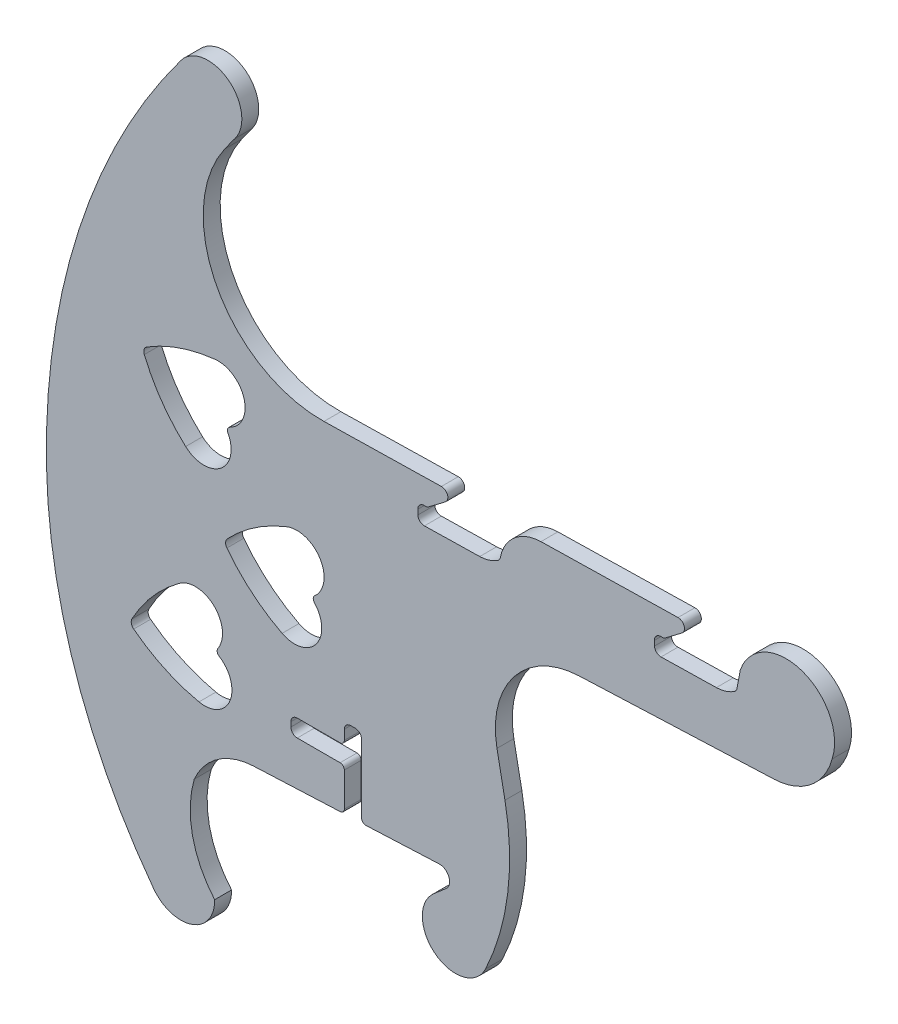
ISO-10303-21;
HEADER;
FILE_DESCRIPTION(('STEP AP214'),'2;1');
FILE_NAME('part.step','',(''),(''),'','','');
FILE_SCHEMA(('AUTOMOTIVE_DESIGN { 1 0 10303 214 1 1 1 1 }'));
ENDSEC;
DATA;
#1=APPLICATION_CONTEXT('core data for automotive mechanical design processes');
#2=APPLICATION_PROTOCOL_DEFINITION('international standard','automotive_design',2000,#1);
#3=PRODUCT_CONTEXT('',#1,'mechanical');
#4=PRODUCT('Part','Part','',(#3));
#5=PRODUCT_RELATED_PRODUCT_CATEGORY('part','',(#4));
#6=PRODUCT_DEFINITION_FORMATION('','',#4);
#7=PRODUCT_DEFINITION_CONTEXT('part definition',#1,'design');
#8=PRODUCT_DEFINITION('design','',#6,#7);
#9=PRODUCT_DEFINITION_SHAPE('','',#8);
#10=(LENGTH_UNIT() NAMED_UNIT(*) SI_UNIT(.MILLI.,.METRE.));
#11=(NAMED_UNIT(*) PLANE_ANGLE_UNIT() SI_UNIT($,.RADIAN.));
#12=(NAMED_UNIT(*) SI_UNIT($,.STERADIAN.) SOLID_ANGLE_UNIT());
#13=UNCERTAINTY_MEASURE_WITH_UNIT(LENGTH_MEASURE(1.E-05),#10,'distance_accuracy_value','');
#14=(GEOMETRIC_REPRESENTATION_CONTEXT(3) GLOBAL_UNCERTAINTY_ASSIGNED_CONTEXT((#13)) GLOBAL_UNIT_ASSIGNED_CONTEXT((#10,
#11,#12)) REPRESENTATION_CONTEXT('',''));
#15=CARTESIAN_POINT('',(0.,0.,0.));
#16=DIRECTION('',(0.,0.,1.));
#17=DIRECTION('',(1.,0.,0.));
#18=AXIS2_PLACEMENT_3D('',#15,#16,#17);
#19=CARTESIAN_POINT('',(-217.310291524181,71.9697151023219,12.7));
#20=DIRECTION('',(0.,0.,1.));
#21=DIRECTION('',(1.,0.,0.));
#22=AXIS2_PLACEMENT_3D('',#19,#20,#21);
#23=CYLINDRICAL_SURFACE('',#22,4.7752000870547);
#24=DIRECTION('',(0.,0.,1.));
#25=VECTOR('',#24,1.);
#26=CARTESIAN_POINT('',(-221.727675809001,70.1560856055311,12.7));
#27=LINE('',#26,#25);
#28=CARTESIAN_POINT('',(-221.727675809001,70.1560856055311,12.7));
#29=VERTEX_POINT('',#28);
#30=CARTESIAN_POINT('',(-221.727675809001,70.1560856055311,25.4));
#31=VERTEX_POINT('',#30);
#32=EDGE_CURVE('E11',#29,#31,#27,.T.);
#33=ORIENTED_EDGE('',*,*,#32,.F.);
#34=CARTESIAN_POINT('',(-217.310291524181,71.9697151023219,12.7));
#35=DIRECTION('',(0.,0.,1.));
#36=DIRECTION('',(1.,0.,0.));
#37=AXIS2_PLACEMENT_3D('',#34,#35,#36);
#38=CIRCLE('',#37,4.7752000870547);
#39=CARTESIAN_POINT('',(-219.818005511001,76.033445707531,12.7));
#40=VERTEX_POINT('',#39);
#41=EDGE_CURVE('E1019',#40,#29,#38,.T.);
#42=ORIENTED_EDGE('',*,*,#41,.F.);
#43=DIRECTION('',(0.,0.,1.));
#44=VECTOR('',#43,1.);
#45=CARTESIAN_POINT('',(-219.818005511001,76.033445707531,12.7));
#46=LINE('',#45,#44);
#47=CARTESIAN_POINT('',(-219.818005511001,76.033445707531,25.4));
#48=VERTEX_POINT('',#47);
#49=EDGE_CURVE('E30',#40,#48,#46,.T.);
#50=ORIENTED_EDGE('',*,*,#49,.T.);
#51=CARTESIAN_POINT('',(-217.310291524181,71.9697151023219,25.4));
#52=DIRECTION('',(0.,0.,1.));
#53=DIRECTION('',(1.,0.,0.));
#54=AXIS2_PLACEMENT_3D('',#51,#52,#53);
#55=CIRCLE('',#54,4.7752000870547);
#56=EDGE_CURVE('E661',#48,#31,#55,.T.);
#57=ORIENTED_EDGE('',*,*,#56,.T.);
#58=EDGE_LOOP('',(#33,#42,#50,#57));
#59=FACE_BOUND('',#58,.T.);
#60=ADVANCED_FACE('F19',(#59),#23,.F.);
#61=CARTESIAN_POINT('',(-155.216022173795,-28.6535383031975,12.7));
#62=DIRECTION('',(0.,0.,1.));
#63=DIRECTION('',(1.,0.,0.));
#64=AXIS2_PLACEMENT_3D('',#61,#62,#63);
#65=CYLINDRICAL_SURFACE('',#64,123.015368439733);
#66=ORIENTED_EDGE('',*,*,#49,.F.);
#67=CARTESIAN_POINT('',(-155.216022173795,-28.6535383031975,12.7));
#68=DIRECTION('',(0.,0.,1.));
#69=DIRECTION('',(1.,0.,0.));
#70=AXIS2_PLACEMENT_3D('',#67,#68,#69);
#71=CIRCLE('',#70,123.015368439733);
#72=CARTESIAN_POINT('',(-168.647232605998,93.6264006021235,12.7));
#73=VERTEX_POINT('',#72);
#74=EDGE_CURVE('E1022',#73,#40,#71,.T.);
#75=ORIENTED_EDGE('',*,*,#74,.F.);
#76=DIRECTION('',(0.,0.,1.));
#77=VECTOR('',#76,1.);
#78=CARTESIAN_POINT('',(-168.647232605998,93.6264006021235,12.7));
#79=LINE('',#78,#77);
#80=CARTESIAN_POINT('',(-168.647232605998,93.6264006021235,25.4));
#81=VERTEX_POINT('',#80);
#82=EDGE_CURVE('E1575',#73,#81,#79,.T.);
#83=ORIENTED_EDGE('',*,*,#82,.T.);
#84=CARTESIAN_POINT('',(-155.216022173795,-28.6535383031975,25.4));
#85=DIRECTION('',(0.,0.,1.));
#86=DIRECTION('',(1.,0.,0.));
#87=AXIS2_PLACEMENT_3D('',#84,#85,#86);
#88=CIRCLE('',#87,123.015368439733);
#89=EDGE_CURVE('E655',#81,#48,#88,.T.);
#90=ORIENTED_EDGE('',*,*,#89,.T.);
#91=EDGE_LOOP('',(#66,#75,#83,#90));
#92=FACE_BOUND('',#91,.T.);
#93=ADVANCED_FACE('F1160',(#92),#65,.F.);
#94=CARTESIAN_POINT('',(-166.417556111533,73.3271928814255,12.7));
#95=DIRECTION('',(0.,0.,1.));
#96=DIRECTION('',(1.,0.,0.));
#97=AXIS2_PLACEMENT_3D('',#94,#95,#96);
#98=CYLINDRICAL_SURFACE('',#97,20.4212950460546);
#99=ORIENTED_EDGE('',*,*,#82,.F.);
#100=CARTESIAN_POINT('',(-166.417556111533,73.3271928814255,12.7));
#101=DIRECTION('',(0.,0.,1.));
#102=DIRECTION('',(1.,0.,0.));
#103=AXIS2_PLACEMENT_3D('',#100,#101,#102);
#104=CIRCLE('',#103,20.4212950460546);
#105=CARTESIAN_POINT('',(-157.494255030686,54.9586330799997,12.7));
#106=VERTEX_POINT('',#105);
#107=EDGE_CURVE('E1026',#106,#73,#104,.T.);
#108=ORIENTED_EDGE('',*,*,#107,.F.);
#109=DIRECTION('',(0.,0.,1.));
#110=VECTOR('',#109,1.);
#111=CARTESIAN_POINT('',(-157.494255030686,54.9586330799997,12.7));
#112=LINE('',#111,#110);
#113=CARTESIAN_POINT('',(-157.494255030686,54.9586330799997,25.4));
#114=VERTEX_POINT('',#113);
#115=EDGE_CURVE('E1572',#106,#114,#112,.T.);
#116=ORIENTED_EDGE('',*,*,#115,.T.);
#117=CARTESIAN_POINT('',(-166.417556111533,73.3271928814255,25.4));
#118=DIRECTION('',(0.,0.,1.));
#119=DIRECTION('',(1.,0.,0.));
#120=AXIS2_PLACEMENT_3D('',#117,#118,#119);
#121=CIRCLE('',#120,20.4212950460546);
#122=EDGE_CURVE('E651',#114,#81,#121,.T.);
#123=ORIENTED_EDGE('',*,*,#122,.T.);
#124=EDGE_LOOP('',(#99,#108,#116,#123));
#125=FACE_BOUND('',#124,.T.);
#126=ADVANCED_FACE('F1165',(#125),#98,.F.);
#127=CARTESIAN_POINT('',(-156.095815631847,52.07992964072,12.7));
#128=DIRECTION('',(0.,0.,-1.));
#129=DIRECTION('',(-1.,0.,0.));
#130=AXIS2_PLACEMENT_3D('',#127,#128,#129);
#131=CYLINDRICAL_SURFACE('',#130,3.20040095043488);
#132=ORIENTED_EDGE('',*,*,#115,.F.);
#133=CARTESIAN_POINT('',(-156.095815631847,52.07992964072,12.7));
#134=DIRECTION('',(0.,0.,-1.));
#135=DIRECTION('',(1.,0.,0.));
#136=AXIS2_PLACEMENT_3D('',#133,#134,#135);
#137=CIRCLE('',#136,3.20040095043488);
#138=CARTESIAN_POINT('',(-159.139575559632,53.0689148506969,12.7));
#139=VERTEX_POINT('',#138);
#140=EDGE_CURVE('E1030',#139,#106,#137,.T.);
#141=ORIENTED_EDGE('',*,*,#140,.F.);
#142=DIRECTION('',(0.,0.,1.));
#143=VECTOR('',#142,1.);
#144=CARTESIAN_POINT('',(-159.139575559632,53.0689148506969,12.7));
#145=LINE('',#144,#143);
#146=CARTESIAN_POINT('',(-159.139575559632,53.0689148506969,25.4));
#147=VERTEX_POINT('',#146);
#148=EDGE_CURVE('E296',#139,#147,#145,.T.);
#149=ORIENTED_EDGE('',*,*,#148,.T.);
#150=CARTESIAN_POINT('',(-156.095815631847,52.07992964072,25.4));
#151=DIRECTION('',(0.,0.,-1.));
#152=DIRECTION('',(-1.,0.,0.));
#153=AXIS2_PLACEMENT_3D('',#150,#151,#152);
#154=CIRCLE('',#153,3.20040095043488);
#155=EDGE_CURVE('E647',#147,#114,#154,.T.);
#156=ORIENTED_EDGE('',*,*,#155,.T.);
#157=EDGE_LOOP('',(#132,#141,#149,#156));
#158=FACE_BOUND('',#157,.T.);
#159=ADVANCED_FACE('F1171',(#158),#131,.T.);
#160=CARTESIAN_POINT('',(-156.09580080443,52.0799309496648,12.7));
#161=DIRECTION('',(0.,0.,-1.));
#162=DIRECTION('',(-1.,0.,0.));
#163=AXIS2_PLACEMENT_3D('',#160,#161,#162);
#164=CYLINDRICAL_SURFACE('',#163,3.20041464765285);
#165=ORIENTED_EDGE('',*,*,#148,.F.);
#166=CARTESIAN_POINT('',(-156.09580080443,52.0799309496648,12.7));
#167=DIRECTION('',(0.,0.,-1.));
#168=DIRECTION('',(1.,0.,0.));
#169=AXIS2_PLACEMENT_3D('',#166,#167,#168);
#170=CIRCLE('',#169,3.20041464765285);
#171=CARTESIAN_POINT('',(-158.919240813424,50.5730001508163,12.7));
#172=VERTEX_POINT('',#171);
#173=EDGE_CURVE('E1038',#172,#139,#170,.T.);
#174=ORIENTED_EDGE('',*,*,#173,.F.);
#175=DIRECTION('',(0.,0.,1.));
#176=VECTOR('',#175,1.);
#177=CARTESIAN_POINT('',(-158.919240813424,50.5730001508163,12.7));
#178=LINE('',#177,#176);
#179=CARTESIAN_POINT('',(-158.919240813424,50.5730001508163,25.4));
#180=VERTEX_POINT('',#179);
#181=EDGE_CURVE('E38',#172,#180,#178,.T.);
#182=ORIENTED_EDGE('',*,*,#181,.T.);
#183=CARTESIAN_POINT('',(-156.09580080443,52.0799309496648,25.4));
#184=DIRECTION('',(0.,0.,-1.));
#185=DIRECTION('',(-1.,0.,0.));
#186=AXIS2_PLACEMENT_3D('',#183,#184,#185);
#187=CIRCLE('',#186,3.20041464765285);
#188=EDGE_CURVE('E635',#180,#147,#187,.T.);
#189=ORIENTED_EDGE('',*,*,#188,.T.);
#190=EDGE_LOOP('',(#165,#174,#182,#189));
#191=FACE_BOUND('',#190,.T.);
#192=ADVANCED_FACE('F1175',(#191),#164,.T.);
#193=CARTESIAN_POINT('',(-176.93511212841,40.957508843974,12.7));
#194=DIRECTION('',(0.,0.,1.));
#195=DIRECTION('',(1.,0.,0.));
#196=AXIS2_PLACEMENT_3D('',#193,#194,#195);
#197=CYLINDRICAL_SURFACE('',#196,20.4212950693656);
#198=ORIENTED_EDGE('',*,*,#181,.F.);
#199=CARTESIAN_POINT('',(-176.93511212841,40.957508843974,12.7));
#200=DIRECTION('',(0.,0.,1.));
#201=DIRECTION('',(1.,0.,0.));
#202=AXIS2_PLACEMENT_3D('',#199,#200,#201);
#203=CIRCLE('',#202,20.4212950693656);
#204=CARTESIAN_POINT('',(-190.670520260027,25.8456639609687,12.7));
#205=VERTEX_POINT('',#204);
#206=EDGE_CURVE('E1008',#205,#172,#203,.T.);
#207=ORIENTED_EDGE('',*,*,#206,.F.);
#208=DIRECTION('',(0.,0.,1.));
#209=VECTOR('',#208,1.);
#210=CARTESIAN_POINT('',(-190.670520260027,25.8456639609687,12.7));
#211=LINE('',#210,#209);
#212=CARTESIAN_POINT('',(-190.670520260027,25.8456639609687,25.4));
#213=VERTEX_POINT('',#212);
#214=EDGE_CURVE('E23',#205,#213,#211,.T.);
#215=ORIENTED_EDGE('',*,*,#214,.T.);
#216=CARTESIAN_POINT('',(-176.93511212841,40.957508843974,25.4));
#217=DIRECTION('',(0.,0.,1.));
#218=DIRECTION('',(1.,0.,0.));
#219=AXIS2_PLACEMENT_3D('',#216,#217,#218);
#220=CIRCLE('',#219,20.4212950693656);
#221=EDGE_CURVE('E545',#213,#180,#220,.T.);
#222=ORIENTED_EDGE('',*,*,#221,.T.);
#223=EDGE_LOOP('',(#198,#207,#215,#222));
#224=FACE_BOUND('',#223,.T.);
#225=ADVANCED_FACE('F1179',(#224),#197,.F.);
#226=CARTESIAN_POINT('',(-226.776516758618,-108.65655256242,12.7));
#227=DIRECTION('',(0.,0.,1.));
#228=DIRECTION('',(1.,0.,0.));
#229=AXIS2_PLACEMENT_3D('',#226,#227,#228);
#230=CYLINDRICAL_SURFACE('',#229,4.77519958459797);
#231=DIRECTION('',(0.,0.,1.));
#232=VECTOR('',#231,1.);
#233=CARTESIAN_POINT('',(-229.695258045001,-112.435901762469,12.7));
#234=LINE('',#233,#232);
#235=CARTESIAN_POINT('',(-229.695258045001,-112.435901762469,12.7));
#236=VERTEX_POINT('',#235);
#237=CARTESIAN_POINT('',(-229.695258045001,-112.435901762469,25.4));
#238=VERTEX_POINT('',#237);
#239=EDGE_CURVE('E508',#236,#238,#234,.T.);
#240=ORIENTED_EDGE('',*,*,#239,.F.);
#241=CARTESIAN_POINT('',(-226.776516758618,-108.65655256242,12.7));
#242=DIRECTION('',(0.,0.,1.));
#243=DIRECTION('',(1.,0.,0.));
#244=AXIS2_PLACEMENT_3D('',#241,#242,#243);
#245=CIRCLE('',#244,4.77519958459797);
#246=CARTESIAN_POINT('',(-230.980132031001,-106.391127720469,12.7));
#247=VERTEX_POINT('',#246);
#248=EDGE_CURVE('E988',#247,#236,#245,.T.);
#249=ORIENTED_EDGE('',*,*,#248,.F.);
#250=DIRECTION('',(0.,0.,1.));
#251=VECTOR('',#250,1.);
#252=CARTESIAN_POINT('',(-230.980132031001,-106.391127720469,12.7));
#253=LINE('',#252,#251);
#254=CARTESIAN_POINT('',(-230.980132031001,-106.391127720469,25.4));
#255=VERTEX_POINT('',#254);
#256=EDGE_CURVE('E580',#247,#255,#253,.T.);
#257=ORIENTED_EDGE('',*,*,#256,.T.);
#258=CARTESIAN_POINT('',(-226.776516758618,-108.65655256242,25.4));
#259=DIRECTION('',(0.,0.,1.));
#260=DIRECTION('',(1.,0.,0.));
#261=AXIS2_PLACEMENT_3D('',#258,#259,#260);
#262=CIRCLE('',#261,4.77519958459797);
#263=EDGE_CURVE('E537',#255,#238,#262,.T.);
#264=ORIENTED_EDGE('',*,*,#263,.T.);
#265=EDGE_LOOP('',(#240,#249,#257,#264));
#266=FACE_BOUND('',#265,.T.);
#267=ADVANCED_FACE('F1182',(#266),#230,.F.);
#268=CARTESIAN_POINT('',(-122.689676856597,-164.751733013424,12.7));
#269=DIRECTION('',(0.,0.,1.));
#270=DIRECTION('',(1.,0.,0.));
#271=AXIS2_PLACEMENT_3D('',#268,#269,#270);
#272=CYLINDRICAL_SURFACE('',#271,123.015376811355);
#273=ORIENTED_EDGE('',*,*,#256,.F.);
#274=CARTESIAN_POINT('',(-122.689676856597,-164.751733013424,12.7));
#275=DIRECTION('',(0.,0.,1.));
#276=DIRECTION('',(1.,0.,0.));
#277=AXIS2_PLACEMENT_3D('',#274,#275,#276);
#278=CIRCLE('',#277,123.015376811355);
#279=CARTESIAN_POINT('',(-195.461411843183,-65.5697915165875,12.7));
#280=VERTEX_POINT('',#279);
#281=EDGE_CURVE('E992',#280,#247,#278,.T.);
#282=ORIENTED_EDGE('',*,*,#281,.F.);
#283=DIRECTION('',(0.,0.,1.));
#284=VECTOR('',#283,1.);
#285=CARTESIAN_POINT('',(-195.461411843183,-65.5697915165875,12.7));
#286=LINE('',#285,#284);
#287=CARTESIAN_POINT('',(-195.461411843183,-65.5697915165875,25.4));
#288=VERTEX_POINT('',#287);
#289=EDGE_CURVE('E582',#280,#288,#286,.T.);
#290=ORIENTED_EDGE('',*,*,#289,.T.);
#291=CARTESIAN_POINT('',(-122.689676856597,-164.751733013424,25.4));
#292=DIRECTION('',(0.,0.,1.));
#293=DIRECTION('',(1.,0.,0.));
#294=AXIS2_PLACEMENT_3D('',#291,#292,#293);
#295=CIRCLE('',#294,123.015376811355);
#296=EDGE_CURVE('E539',#288,#255,#295,.T.);
#297=ORIENTED_EDGE('',*,*,#296,.T.);
#298=EDGE_LOOP('',(#273,#282,#290,#297));
#299=FACE_BOUND('',#298,.T.);
#300=ADVANCED_FACE('F578',(#299),#272,.F.);
#301=CARTESIAN_POINT('',(-183.380842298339,-82.0345740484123,12.7));
#302=DIRECTION('',(0.,0.,1.));
#303=DIRECTION('',(1.,0.,0.));
#304=AXIS2_PLACEMENT_3D('',#301,#302,#303);
#305=CYLINDRICAL_SURFACE('',#304,20.4212934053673);
#306=ORIENTED_EDGE('',*,*,#289,.F.);
#307=CARTESIAN_POINT('',(-183.380842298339,-82.0345740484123,12.7));
#308=DIRECTION('',(0.,0.,1.));
#309=DIRECTION('',(1.,0.,0.));
#310=AXIS2_PLACEMENT_3D('',#307,#308,#309);
#311=CIRCLE('',#310,20.4212934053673);
#312=CARTESIAN_POINT('',(-166.468759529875,-93.4805637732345,12.7));
#313=VERTEX_POINT('',#312);
#314=EDGE_CURVE('E590',#313,#280,#311,.T.);
#315=ORIENTED_EDGE('',*,*,#314,.F.);
#316=DIRECTION('',(0.,0.,1.));
#317=VECTOR('',#316,1.);
#318=CARTESIAN_POINT('',(-166.468759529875,-93.4805637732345,12.7));
#319=LINE('',#318,#317);
#320=CARTESIAN_POINT('',(-166.468759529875,-93.4805637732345,25.4));
#321=VERTEX_POINT('',#320);
#322=EDGE_CURVE('E589',#313,#321,#319,.T.);
#323=ORIENTED_EDGE('',*,*,#322,.T.);
#324=CARTESIAN_POINT('',(-183.380842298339,-82.0345740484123,25.4));
#325=DIRECTION('',(0.,0.,1.));
#326=DIRECTION('',(1.,0.,0.));
#327=AXIS2_PLACEMENT_3D('',#324,#325,#326);
#328=CIRCLE('',#327,20.4212934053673);
#329=EDGE_CURVE('E571',#321,#288,#328,.T.);
#330=ORIENTED_EDGE('',*,*,#329,.T.);
#331=EDGE_LOOP('',(#306,#315,#323,#330));
#332=FACE_BOUND('',#331,.T.);
#333=ADVANCED_FACE('F586',(#332),#305,.F.);
#334=CARTESIAN_POINT('',(-163.81829617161,-95.2743454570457,12.7));
#335=DIRECTION('',(0.,0.,-1.));
#336=DIRECTION('',(-1.,0.,0.));
#337=AXIS2_PLACEMENT_3D('',#334,#335,#336);
#338=CYLINDRICAL_SURFACE('',#337,3.20040759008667);
#339=ORIENTED_EDGE('',*,*,#322,.F.);
#340=CARTESIAN_POINT('',(-163.81829617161,-95.2743454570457,12.7));
#341=DIRECTION('',(0.,0.,-1.));
#342=DIRECTION('',(1.,0.,0.));
#343=AXIS2_PLACEMENT_3D('',#340,#341,#342);
#344=CIRCLE('',#343,3.20040759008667);
#345=CARTESIAN_POINT('',(-166.948761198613,-95.9397757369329,12.7));
#346=VERTEX_POINT('',#345);
#347=EDGE_CURVE('E1002',#346,#313,#344,.T.);
#348=ORIENTED_EDGE('',*,*,#347,.F.);
#349=DIRECTION('',(0.,0.,1.));
#350=VECTOR('',#349,1.);
#351=CARTESIAN_POINT('',(-166.948761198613,-95.9397757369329,12.7));
#352=LINE('',#351,#350);
#353=CARTESIAN_POINT('',(-166.948761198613,-95.9397757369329,25.4));
#354=VERTEX_POINT('',#353);
#355=EDGE_CURVE('E594',#346,#354,#352,.T.);
#356=ORIENTED_EDGE('',*,*,#355,.T.);
#357=CARTESIAN_POINT('',(-163.81829617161,-95.2743454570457,25.4));
#358=DIRECTION('',(0.,0.,-1.));
#359=DIRECTION('',(-1.,0.,0.));
#360=AXIS2_PLACEMENT_3D('',#357,#358,#359);
#361=CIRCLE('',#360,3.20040759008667);
#362=EDGE_CURVE('E563',#354,#321,#361,.T.);
#363=ORIENTED_EDGE('',*,*,#362,.T.);
#364=EDGE_LOOP('',(#339,#348,#356,#363));
#365=FACE_BOUND('',#364,.T.);
#366=ADVANCED_FACE('F1193',(#365),#338,.T.);
#367=CARTESIAN_POINT('',(-163.818297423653,-95.2743753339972,12.7));
#368=DIRECTION('',(0.,0.,-1.));
#369=DIRECTION('',(-1.,0.,0.));
#370=AXIS2_PLACEMENT_3D('',#367,#368,#369);
#371=CYLINDRICAL_SURFACE('',#370,3.20040015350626);
#372=ORIENTED_EDGE('',*,*,#355,.F.);
#373=CARTESIAN_POINT('',(-163.818297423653,-95.2743753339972,12.7));
#374=DIRECTION('',(0.,0.,-1.));
#375=DIRECTION('',(1.,0.,0.));
#376=AXIS2_PLACEMENT_3D('',#373,#374,#375);
#377=CIRCLE('',#376,3.20040015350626);
#378=CARTESIAN_POINT('',(-165.509991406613,-97.9911257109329,12.7));
#379=VERTEX_POINT('',#378);
#380=EDGE_CURVE('E1004',#379,#346,#377,.T.);
#381=ORIENTED_EDGE('',*,*,#380,.F.);
#382=DIRECTION('',(0.,0.,1.));
#383=VECTOR('',#382,1.);
#384=CARTESIAN_POINT('',(-165.509991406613,-97.9911257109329,12.7));
#385=LINE('',#384,#383);
#386=CARTESIAN_POINT('',(-165.509991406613,-97.9911257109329,25.4));
#387=VERTEX_POINT('',#386);
#388=EDGE_CURVE('E522',#379,#387,#385,.T.);
#389=ORIENTED_EDGE('',*,*,#388,.T.);
#390=CARTESIAN_POINT('',(-163.818297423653,-95.2743753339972,25.4));
#391=DIRECTION('',(0.,0.,-1.));
#392=DIRECTION('',(-1.,0.,0.));
#393=AXIS2_PLACEMENT_3D('',#390,#391,#392);
#394=CIRCLE('',#393,3.20040015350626);
#395=EDGE_CURVE('E533',#387,#354,#394,.T.);
#396=ORIENTED_EDGE('',*,*,#395,.T.);
#397=EDGE_LOOP('',(#372,#381,#389,#396));
#398=FACE_BOUND('',#397,.T.);
#399=ADVANCED_FACE('F1196',(#398),#371,.T.);
#400=CARTESIAN_POINT('',(-176.304455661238,-115.326330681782,12.7));
#401=DIRECTION('',(0.,0.,1.));
#402=DIRECTION('',(1.,0.,0.));
#403=AXIS2_PLACEMENT_3D('',#400,#401,#402);
#404=CYLINDRICAL_SURFACE('',#403,20.4213072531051);
#405=ORIENTED_EDGE('',*,*,#388,.F.);
#406=CARTESIAN_POINT('',(-176.304455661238,-115.326330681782,12.7));
#407=DIRECTION('',(0.,0.,1.));
#408=DIRECTION('',(1.,0.,0.));
#409=AXIS2_PLACEMENT_3D('',#406,#407,#408);
#410=CIRCLE('',#409,20.4213072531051);
#411=CARTESIAN_POINT('',(-180.643746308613,-135.281288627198,12.7));
#412=VERTEX_POINT('',#411);
#413=EDGE_CURVE('E520',#412,#379,#410,.T.);
#414=ORIENTED_EDGE('',*,*,#413,.F.);
#415=DIRECTION('',(0.,0.,1.));
#416=VECTOR('',#415,1.);
#417=CARTESIAN_POINT('',(-180.643746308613,-135.281288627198,12.7));
#418=LINE('',#417,#416);
#419=CARTESIAN_POINT('',(-180.643746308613,-135.281288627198,25.4));
#420=VERTEX_POINT('',#419);
#421=EDGE_CURVE('E514',#412,#420,#418,.T.);
#422=ORIENTED_EDGE('',*,*,#421,.T.);
#423=CARTESIAN_POINT('',(-176.304455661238,-115.326330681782,25.4));
#424=DIRECTION('',(0.,0.,1.));
#425=DIRECTION('',(1.,0.,0.));
#426=AXIS2_PLACEMENT_3D('',#423,#424,#425);
#427=CIRCLE('',#426,20.4213072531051);
#428=EDGE_CURVE('E517',#420,#387,#427,.T.);
#429=ORIENTED_EDGE('',*,*,#428,.T.);
#430=EDGE_LOOP('',(#405,#414,#422,#429));
#431=FACE_BOUND('',#430,.T.);
#432=ADVANCED_FACE('F516',(#431),#404,.F.);
#433=CARTESIAN_POINT('',(225.956460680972,88.6466112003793,12.7));
#434=DIRECTION('',(-0.98316193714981,0.182736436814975,0.));
#435=DIRECTION('',(-0.182736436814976,-0.98316193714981,0.));
#436=AXIS2_PLACEMENT_3D('',#433,#434,#435);
#437=PLANE('',#436);
#438=DIRECTION('',(0.,0.,1.));
#439=VECTOR('',#438,1.);
#440=CARTESIAN_POINT('',(225.956460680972,88.6466112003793,12.7));
#441=LINE('',#440,#439);
#442=CARTESIAN_POINT('',(225.956460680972,88.6466112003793,12.7));
#443=VERTEX_POINT('',#442);
#444=CARTESIAN_POINT('',(225.956460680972,88.6466112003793,25.4));
#445=VERTEX_POINT('',#444);
#446=EDGE_CURVE('E523',#443,#445,#441,.T.);
#447=ORIENTED_EDGE('',*,*,#446,.F.);
#448=DIRECTION('',(-0.182736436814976,-0.98316193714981,0.));
#449=VECTOR('',#448,1.);
#450=CARTESIAN_POINT('',(225.956460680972,88.6466112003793,12.7));
#451=LINE('',#450,#449);
#452=CARTESIAN_POINT('',(223.539222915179,75.6413441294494,12.7));
#453=VERTEX_POINT('',#452);
#454=EDGE_CURVE('E713',#443,#453,#451,.T.);
#455=ORIENTED_EDGE('',*,*,#454,.T.);
#456=DIRECTION('',(0.,0.,1.));
#457=VECTOR('',#456,1.);
#458=CARTESIAN_POINT('',(223.539222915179,75.6413441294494,12.7));
#459=LINE('',#458,#457);
#460=CARTESIAN_POINT('',(223.539222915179,75.6413441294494,25.4));
#461=VERTEX_POINT('',#460);
#462=EDGE_CURVE('E2249',#453,#461,#459,.T.);
#463=ORIENTED_EDGE('',*,*,#462,.T.);
#464=DIRECTION('',(-0.182736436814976,-0.98316193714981,0.));
#465=VECTOR('',#464,1.);
#466=CARTESIAN_POINT('',(225.956460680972,88.6466112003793,25.4));
#467=LINE('',#466,#465);
#468=EDGE_CURVE('E2257',#445,#461,#467,.T.);
#469=ORIENTED_EDGE('',*,*,#468,.F.);
#470=EDGE_LOOP('',(#447,#455,#463,#469));
#471=FACE_BOUND('',#470,.T.);
#472=ADVANCED_FACE('F1202',(#471),#437,.T.);
#473=CARTESIAN_POINT('',(218.85691406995,76.5116252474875,12.7));
#474=DIRECTION('',(0.,0.,-1.));
#475=DIRECTION('',(-1.,0.,0.));
#476=AXIS2_PLACEMENT_3D('',#473,#474,#475);
#477=CYLINDRICAL_SURFACE('',#476,4.76249990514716);
#478=ORIENTED_EDGE('',*,*,#462,.F.);
#479=CARTESIAN_POINT('',(218.85691406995,76.5116252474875,12.7));
#480=DIRECTION('',(0.,0.,-1.));
#481=DIRECTION('',(1.,0.,0.));
#482=AXIS2_PLACEMENT_3D('',#479,#480,#481);
#483=CIRCLE('',#482,4.76249990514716);
#484=CARTESIAN_POINT('',(221.476438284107,72.5342519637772,12.7));
#485=VERTEX_POINT('',#484);
#486=EDGE_CURVE('E721',#453,#485,#483,.T.);
#487=ORIENTED_EDGE('',*,*,#486,.T.);
#488=DIRECTION('',(0.,0.,1.));
#489=VECTOR('',#488,1.);
#490=CARTESIAN_POINT('',(221.476438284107,72.5342519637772,12.7));
#491=LINE('',#490,#489);
#492=CARTESIAN_POINT('',(221.476438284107,72.5342519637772,25.4));
#493=VERTEX_POINT('',#492);
#494=EDGE_CURVE('E2247',#485,#493,#491,.T.);
#495=ORIENTED_EDGE('',*,*,#494,.T.);
#496=CARTESIAN_POINT('',(218.85691406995,76.5116252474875,25.4));
#497=DIRECTION('',(0.,0.,-1.));
#498=DIRECTION('',(-1.,0.,0.));
#499=AXIS2_PLACEMENT_3D('',#496,#497,#498);
#500=CIRCLE('',#499,4.76249990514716);
#501=EDGE_CURVE('E2259',#461,#493,#500,.T.);
#502=ORIENTED_EDGE('',*,*,#501,.F.);
#503=EDGE_LOOP('',(#478,#487,#495,#502));
#504=FACE_BOUND('',#503,.T.);
#505=ADVANCED_FACE('F1208',(#504),#477,.F.);
#506=CARTESIAN_POINT('',(207.505650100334,93.7468803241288,12.7));
#507=DIRECTION('',(0.,0.,-1.));
#508=DIRECTION('',(-1.,0.,0.));
#509=AXIS2_PLACEMENT_3D('',#506,#507,#508);
#510=CYLINDRICAL_SURFACE('',#509,25.3999709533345);
#511=ORIENTED_EDGE('',*,*,#494,.F.);
#512=CARTESIAN_POINT('',(207.505650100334,93.7468803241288,12.7));
#513=DIRECTION('',(0.,0.,-1.));
#514=DIRECTION('',(1.,0.,0.));
#515=AXIS2_PLACEMENT_3D('',#512,#513,#514);
#516=CIRCLE('',#515,25.3999709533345);
#517=CARTESIAN_POINT('',(208.022056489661,68.3521594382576,12.7));
#518=VERTEX_POINT('',#517);
#519=EDGE_CURVE('E724',#485,#518,#516,.T.);
#520=ORIENTED_EDGE('',*,*,#519,.T.);
#521=DIRECTION('',(0.,0.,1.));
#522=VECTOR('',#521,1.);
#523=CARTESIAN_POINT('',(208.022056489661,68.3521594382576,12.7));
#524=LINE('',#523,#522);
#525=CARTESIAN_POINT('',(208.022056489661,68.3521594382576,25.4));
#526=VERTEX_POINT('',#525);
#527=EDGE_CURVE('E2245',#518,#526,#524,.T.);
#528=ORIENTED_EDGE('',*,*,#527,.T.);
#529=CARTESIAN_POINT('',(207.505650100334,93.7468803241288,25.4));
#530=DIRECTION('',(0.,0.,-1.));
#531=DIRECTION('',(-1.,0.,0.));
#532=AXIS2_PLACEMENT_3D('',#529,#530,#531);
#533=CIRCLE('',#532,25.3999709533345);
#534=EDGE_CURVE('E2260',#493,#526,#533,.T.);
#535=ORIENTED_EDGE('',*,*,#534,.F.);
#536=EDGE_LOOP('',(#511,#520,#528,#535));
#537=FACE_BOUND('',#536,.T.);
#538=ADVANCED_FACE('F1212',(#537),#510,.F.);
#539=CARTESIAN_POINT('',(208.022056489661,68.3521594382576,12.7));
#540=DIRECTION('',(-0.0203306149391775,0.999793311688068,0.));
#541=DIRECTION('',(-0.999793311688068,-0.0203306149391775,0.));
#542=AXIS2_PLACEMENT_3D('',#539,#540,#541);
#543=PLANE('',#542);
#544=ORIENTED_EDGE('',*,*,#527,.F.);
#545=DIRECTION('',(-0.999793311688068,-0.0203306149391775,0.));
#546=VECTOR('',#545,1.);
#547=CARTESIAN_POINT('',(208.022056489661,68.3521594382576,12.7));
#548=LINE('',#547,#546);
#549=CARTESIAN_POINT('',(166.450850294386,67.5068165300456,12.7));
#550=VERTEX_POINT('',#549);
#551=EDGE_CURVE('E728',#518,#550,#548,.T.);
#552=ORIENTED_EDGE('',*,*,#551,.T.);
#553=DIRECTION('',(0.,0.,1.));
#554=VECTOR('',#553,1.);
#555=CARTESIAN_POINT('',(166.450850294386,67.5068165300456,12.7));
#556=LINE('',#555,#554);
#557=CARTESIAN_POINT('',(166.450850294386,67.5068165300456,25.4));
#558=VERTEX_POINT('',#557);
#559=EDGE_CURVE('E2237',#550,#558,#556,.T.);
#560=ORIENTED_EDGE('',*,*,#559,.T.);
#561=DIRECTION('',(-0.999793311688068,-0.0203306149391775,0.));
#562=VECTOR('',#561,1.);
#563=CARTESIAN_POINT('',(208.022056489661,68.3521594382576,25.4));
#564=LINE('',#563,#562);
#565=EDGE_CURVE('E2272',#526,#558,#564,.T.);
#566=ORIENTED_EDGE('',*,*,#565,.F.);
#567=EDGE_LOOP('',(#544,#552,#560,#566));
#568=FACE_BOUND('',#567,.T.);
#569=ADVANCED_FACE('F1216',(#568),#543,.T.);
#570=CARTESIAN_POINT('',(166.353767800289,72.2810302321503,12.7));
#571=DIRECTION('',(0.,0.,-1.));
#572=DIRECTION('',(-1.,0.,0.));
#573=AXIS2_PLACEMENT_3D('',#570,#571,#572);
#574=CYLINDRICAL_SURFACE('',#573,4.77520067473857);
#575=ORIENTED_EDGE('',*,*,#559,.F.);
#576=CARTESIAN_POINT('',(166.353767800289,72.2810302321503,12.7));
#577=DIRECTION('',(0.,0.,-1.));
#578=DIRECTION('',(1.,0.,0.));
#579=AXIS2_PLACEMENT_3D('',#576,#577,#578);
#580=CIRCLE('',#579,4.77520067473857);
#581=CARTESIAN_POINT('',(161.57958795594,72.1822967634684,12.7));
#582=VERTEX_POINT('',#581);
#583=EDGE_CURVE('E732',#550,#582,#580,.T.);
#584=ORIENTED_EDGE('',*,*,#583,.T.);
#585=DIRECTION('',(0.,0.,1.));
#586=VECTOR('',#585,1.);
#587=CARTESIAN_POINT('',(161.57958795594,72.1822967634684,12.7));
#588=LINE('',#587,#586);
#589=CARTESIAN_POINT('',(161.57958795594,72.1822967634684,25.4));
#590=VERTEX_POINT('',#589);
#591=EDGE_CURVE('E2234',#582,#590,#588,.T.);
#592=ORIENTED_EDGE('',*,*,#591,.T.);
#593=CARTESIAN_POINT('',(166.353767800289,72.2810302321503,25.4));
#594=DIRECTION('',(0.,0.,-1.));
#595=DIRECTION('',(-1.,0.,0.));
#596=AXIS2_PLACEMENT_3D('',#593,#594,#595);
#597=CIRCLE('',#596,4.77520067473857);
#598=EDGE_CURVE('E2276',#558,#590,#597,.T.);
#599=ORIENTED_EDGE('',*,*,#598,.F.);
#600=EDGE_LOOP('',(#575,#584,#592,#599));
#601=FACE_BOUND('',#600,.T.);
#602=ADVANCED_FACE('F1220',(#601),#574,.F.);
#603=CARTESIAN_POINT('',(161.57958795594,72.1822967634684,12.7));
#604=DIRECTION('',(0.999793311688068,0.0203306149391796,0.));
#605=DIRECTION('',(-0.0203306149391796,0.999793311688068,0.));
#606=AXIS2_PLACEMENT_3D('',#603,#604,#605);
#607=PLANE('',#606);
#608=ORIENTED_EDGE('',*,*,#591,.F.);
#609=DIRECTION('',(-0.0203306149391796,0.999793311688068,0.));
#610=VECTOR('',#609,1.);
#611=CARTESIAN_POINT('',(161.57958795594,72.1822967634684,12.7));
#612=LINE('',#611,#610);
#613=CARTESIAN_POINT('',(161.505193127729,75.8407916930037,12.7));
#614=VERTEX_POINT('',#613);
#615=EDGE_CURVE('E740',#582,#614,#612,.T.);
#616=ORIENTED_EDGE('',*,*,#615,.T.);
#617=DIRECTION('',(0.,0.,1.));
#618=VECTOR('',#617,1.);
#619=CARTESIAN_POINT('',(161.505193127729,75.8407916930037,12.7));
#620=LINE('',#619,#618);
#621=CARTESIAN_POINT('',(161.505193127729,75.8407916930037,25.4));
#622=VERTEX_POINT('',#621);
#623=EDGE_CURVE('E2231',#614,#622,#620,.T.);
#624=ORIENTED_EDGE('',*,*,#623,.T.);
#625=DIRECTION('',(-0.0203306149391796,0.999793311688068,0.));
#626=VECTOR('',#625,1.);
#627=CARTESIAN_POINT('',(161.57958795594,72.1822967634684,25.4));
#628=LINE('',#627,#626);
#629=EDGE_CURVE('E2280',#590,#622,#628,.T.);
#630=ORIENTED_EDGE('',*,*,#629,.F.);
#631=EDGE_LOOP('',(#608,#616,#624,#630));
#632=FACE_BOUND('',#631,.T.);
#633=ADVANCED_FACE('F1224',(#632),#607,.T.);
#634=CARTESIAN_POINT('',(166.279406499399,75.9378742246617,12.7));
#635=DIRECTION('',(0.,0.,-1.));
#636=DIRECTION('',(-1.,0.,0.));
#637=AXIS2_PLACEMENT_3D('',#634,#635,#636);
#638=CYLINDRICAL_SURFACE('',#637,4.77520034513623);
#639=ORIENTED_EDGE('',*,*,#623,.F.);
#640=CARTESIAN_POINT('',(166.279406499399,75.9378742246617,12.7));
#641=DIRECTION('',(0.,0.,-1.));
#642=DIRECTION('',(1.,0.,0.));
#643=AXIS2_PLACEMENT_3D('',#640,#641,#642);
#644=CIRCLE('',#643,4.77520034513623);
#645=CARTESIAN_POINT('',(166.182323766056,80.7120875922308,12.7));
#646=VERTEX_POINT('',#645);
#647=EDGE_CURVE('E743',#614,#646,#644,.T.);
#648=ORIENTED_EDGE('',*,*,#647,.T.);
#649=DIRECTION('',(0.,0.,1.));
#650=VECTOR('',#649,1.);
#651=CARTESIAN_POINT('',(166.182323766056,80.7120875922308,12.7));
#652=LINE('',#651,#650);
#653=CARTESIAN_POINT('',(166.182323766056,80.7120875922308,25.4));
#654=VERTEX_POINT('',#653);
#655=EDGE_CURVE('E2229',#646,#654,#652,.T.);
#656=ORIENTED_EDGE('',*,*,#655,.T.);
#657=CARTESIAN_POINT('',(166.279406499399,75.9378742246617,25.4));
#658=DIRECTION('',(0.,0.,-1.));
#659=DIRECTION('',(-1.,0.,0.));
#660=AXIS2_PLACEMENT_3D('',#657,#658,#659);
#661=CIRCLE('',#660,4.77520034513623);
#662=EDGE_CURVE('E2288',#622,#654,#661,.T.);
#663=ORIENTED_EDGE('',*,*,#662,.F.);
#664=EDGE_LOOP('',(#639,#648,#656,#663));
#665=FACE_BOUND('',#664,.T.);
#666=ADVANCED_FACE('F1228',(#665),#638,.F.);
#667=CARTESIAN_POINT('',(166.182323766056,80.7120875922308,12.7));
#668=DIRECTION('',(0.0203306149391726,-0.999793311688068,0.));
#669=DIRECTION('',(0.999793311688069,0.0203306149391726,0.));
#670=AXIS2_PLACEMENT_3D('',#667,#668,#669);
#671=PLANE('',#670);
#672=ORIENTED_EDGE('',*,*,#655,.F.);
#673=DIRECTION('',(0.999793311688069,0.0203306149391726,0.));
#674=VECTOR('',#673,1.);
#675=CARTESIAN_POINT('',(166.182323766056,80.7120875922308,12.7));
#676=LINE('',#675,#674);
#677=CARTESIAN_POINT('',(168.721798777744,80.7637273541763,12.7));
#678=VERTEX_POINT('',#677);
#679=EDGE_CURVE('E747',#646,#678,#676,.T.);
#680=ORIENTED_EDGE('',*,*,#679,.T.);
#681=DIRECTION('',(0.,0.,1.));
#682=VECTOR('',#681,1.);
#683=CARTESIAN_POINT('',(168.721798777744,80.7637273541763,12.7));
#684=LINE('',#683,#682);
#685=CARTESIAN_POINT('',(168.721798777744,80.7637273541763,25.4));
#686=VERTEX_POINT('',#685);
#687=EDGE_CURVE('E2221',#678,#686,#684,.T.);
#688=ORIENTED_EDGE('',*,*,#687,.T.);
#689=DIRECTION('',(0.999793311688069,0.0203306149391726,0.));
#690=VECTOR('',#689,1.);
#691=CARTESIAN_POINT('',(166.182323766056,80.7120875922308,25.4));
#692=LINE('',#691,#690);
#693=EDGE_CURVE('E2291',#654,#686,#692,.T.);
#694=ORIENTED_EDGE('',*,*,#693,.F.);
#695=EDGE_LOOP('',(#672,#680,#688,#694));
#696=FACE_BOUND('',#695,.T.);
#697=ADVANCED_FACE('F1232',(#696),#671,.T.);
#698=CARTESIAN_POINT('',(168.721798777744,80.7637273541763,12.7));
#699=DIRECTION('',(0.604239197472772,-0.796802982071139,0.));
#700=DIRECTION('',(0.796802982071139,0.604239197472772,0.));
#701=AXIS2_PLACEMENT_3D('',#698,#699,#700);
#702=PLANE('',#701);
#703=ORIENTED_EDGE('',*,*,#687,.F.);
#704=DIRECTION('',(0.796802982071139,0.604239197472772,0.));
#705=VECTOR('',#704,1.);
#706=CARTESIAN_POINT('',(168.721798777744,80.7637273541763,12.7));
#707=LINE('',#706,#705);
#708=CARTESIAN_POINT('',(182.175902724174,90.9663711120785,12.7));
#709=VERTEX_POINT('',#708);
#710=EDGE_CURVE('E751',#678,#709,#707,.T.);
#711=ORIENTED_EDGE('',*,*,#710,.T.);
#712=DIRECTION('',(0.,0.,1.));
#713=VECTOR('',#712,1.);
#714=CARTESIAN_POINT('',(182.175902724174,90.9663711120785,12.7));
#715=LINE('',#714,#713);
#716=CARTESIAN_POINT('',(182.175902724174,90.9663711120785,25.4));
#717=VERTEX_POINT('',#716);
#718=EDGE_CURVE('E2218',#709,#717,#715,.T.);
#719=ORIENTED_EDGE('',*,*,#718,.T.);
#720=DIRECTION('',(0.796802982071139,0.604239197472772,0.));
#721=VECTOR('',#720,1.);
#722=CARTESIAN_POINT('',(168.721798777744,80.7637273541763,25.4));
#723=LINE('',#722,#721);
#724=EDGE_CURVE('E2295',#686,#717,#723,.T.);
#725=ORIENTED_EDGE('',*,*,#724,.F.);
#726=EDGE_LOOP('',(#703,#711,#719,#725));
#727=FACE_BOUND('',#726,.T.);
#728=ADVANCED_FACE('F1236',(#727),#702,.T.);
#729=CARTESIAN_POINT('',(179.298213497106,94.7611453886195,12.7));
#730=DIRECTION('',(0.,0.,1.));
#731=DIRECTION('',(1.,0.,0.));
#732=AXIS2_PLACEMENT_3D('',#729,#730,#731);
#733=CYLINDRICAL_SURFACE('',#732,4.76250008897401);
#734=ORIENTED_EDGE('',*,*,#718,.F.);
#735=CARTESIAN_POINT('',(179.298213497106,94.7611453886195,12.7));
#736=DIRECTION('',(0.,0.,1.));
#737=DIRECTION('',(1.,0.,0.));
#738=AXIS2_PLACEMENT_3D('',#735,#736,#737);
#739=CIRCLE('',#738,4.76250008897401);
#740=CARTESIAN_POINT('',(179.201388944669,99.5226611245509,12.7));
#741=VERTEX_POINT('',#740);
#742=EDGE_CURVE('E759',#709,#741,#739,.T.);
#743=ORIENTED_EDGE('',*,*,#742,.T.);
#744=DIRECTION('',(0.,0.,1.));
#745=VECTOR('',#744,1.);
#746=CARTESIAN_POINT('',(179.201388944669,99.5226611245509,12.7));
#747=LINE('',#746,#745);
#748=CARTESIAN_POINT('',(179.201388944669,99.5226611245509,25.4));
#749=VERTEX_POINT('',#748);
#750=EDGE_CURVE('E2215',#741,#749,#747,.T.);
#751=ORIENTED_EDGE('',*,*,#750,.T.);
#752=CARTESIAN_POINT('',(179.298213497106,94.7611453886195,25.4));
#753=DIRECTION('',(0.,0.,1.));
#754=DIRECTION('',(1.,0.,0.));
#755=AXIS2_PLACEMENT_3D('',#752,#753,#754);
#756=CIRCLE('',#755,4.76250008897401);
#757=EDGE_CURVE('E2299',#717,#749,#756,.T.);
#758=ORIENTED_EDGE('',*,*,#757,.F.);
#759=EDGE_LOOP('',(#734,#743,#751,#758));
#760=FACE_BOUND('',#759,.T.);
#761=ADVANCED_FACE('F1240',(#760),#733,.T.);
#762=CARTESIAN_POINT('',(179.201388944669,99.5226611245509,12.7));
#763=DIRECTION('',(-0.0203306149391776,0.999793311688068,0.));
#764=DIRECTION('',(-0.999793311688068,-0.0203306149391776,0.));
#765=AXIS2_PLACEMENT_3D('',#762,#763,#764);
#766=PLANE('',#765);
#767=ORIENTED_EDGE('',*,*,#750,.F.);
#768=DIRECTION('',(-0.999793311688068,-0.0203306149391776,0.));
#769=VECTOR('',#768,1.);
#770=CARTESIAN_POINT('',(179.201388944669,99.5226611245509,12.7));
#771=LINE('',#770,#769);
#772=CARTESIAN_POINT('',(76.2414745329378,97.4289900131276,12.7));
#773=VERTEX_POINT('',#772);
#774=EDGE_CURVE('E762',#741,#773,#771,.T.);
#775=ORIENTED_EDGE('',*,*,#774,.T.);
#776=DIRECTION('',(0.,0.,1.));
#777=VECTOR('',#776,1.);
#778=CARTESIAN_POINT('',(76.2414745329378,97.4289900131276,12.7));
#779=LINE('',#778,#777);
#780=CARTESIAN_POINT('',(76.2414745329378,97.4289900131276,25.4));
#781=VERTEX_POINT('',#780);
#782=EDGE_CURVE('E2213',#773,#781,#779,.T.);
#783=ORIENTED_EDGE('',*,*,#782,.T.);
#784=DIRECTION('',(-0.999793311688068,-0.0203306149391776,0.));
#785=VECTOR('',#784,1.);
#786=CARTESIAN_POINT('',(179.201388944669,99.5226611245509,25.4));
#787=LINE('',#786,#785);
#788=EDGE_CURVE('E2307',#749,#781,#787,.T.);
#789=ORIENTED_EDGE('',*,*,#788,.F.);
#790=EDGE_LOOP('',(#767,#775,#783,#789));
#791=FACE_BOUND('',#790,.T.);
#792=ADVANCED_FACE('F1244',(#791),#766,.T.);
#793=CARTESIAN_POINT('',(76.8869648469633,65.6855434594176,12.7));
#794=DIRECTION('',(0.,0.,1.));
#795=DIRECTION('',(1.,0.,0.));
#796=AXIS2_PLACEMENT_3D('',#793,#794,#795);
#797=CYLINDRICAL_SURFACE('',#796,31.7500087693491);
#798=ORIENTED_EDGE('',*,*,#782,.F.);
#799=CARTESIAN_POINT('',(76.8869648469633,65.6855434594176,12.7));
#800=DIRECTION('',(0.,0.,1.));
#801=DIRECTION('',(1.,0.,0.));
#802=AXIS2_PLACEMENT_3D('',#799,#800,#801);
#803=CIRCLE('',#802,31.7500087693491);
#804=CARTESIAN_POINT('',(45.7623535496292,71.9562394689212,12.7));
#805=VERTEX_POINT('',#804);
#806=EDGE_CURVE('E766',#773,#805,#803,.T.);
#807=ORIENTED_EDGE('',*,*,#806,.T.);
#808=DIRECTION('',(0.,0.,1.));
#809=VECTOR('',#808,1.);
#810=CARTESIAN_POINT('',(45.7623535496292,71.9562394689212,12.7));
#811=LINE('',#810,#809);
#812=CARTESIAN_POINT('',(45.7623535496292,71.9562394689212,25.4));
#813=VERTEX_POINT('',#812);
#814=EDGE_CURVE('E2205',#805,#813,#811,.T.);
#815=ORIENTED_EDGE('',*,*,#814,.T.);
#816=CARTESIAN_POINT('',(76.8869648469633,65.6855434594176,25.4));
#817=DIRECTION('',(0.,0.,1.));
#818=DIRECTION('',(1.,0.,0.));
#819=AXIS2_PLACEMENT_3D('',#816,#817,#818);
#820=CIRCLE('',#819,31.7500087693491);
#821=EDGE_CURVE('E2310',#781,#813,#820,.T.);
#822=ORIENTED_EDGE('',*,*,#821,.F.);
#823=EDGE_LOOP('',(#798,#807,#815,#822));
#824=FACE_BOUND('',#823,.T.);
#825=ADVANCED_FACE('F1248',(#824),#797,.T.);
#826=CARTESIAN_POINT('',(41.093663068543,72.8968429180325,12.7));
#827=DIRECTION('',(0.,0.,-1.));
#828=DIRECTION('',(-1.,0.,0.));
#829=AXIS2_PLACEMENT_3D('',#826,#827,#828);
#830=CYLINDRICAL_SURFACE('',#829,4.76249993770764);
#831=ORIENTED_EDGE('',*,*,#814,.F.);
#832=CARTESIAN_POINT('',(41.093663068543,72.8968429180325,12.7));
#833=DIRECTION('',(0.,0.,-1.));
#834=DIRECTION('',(1.,0.,0.));
#835=AXIS2_PLACEMENT_3D('',#832,#833,#834);
#836=CIRCLE('',#835,4.76249993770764);
#837=CARTESIAN_POINT('',(43.7131872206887,68.9194695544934,12.7));
#838=VERTEX_POINT('',#837);
#839=EDGE_CURVE('E770',#805,#838,#836,.T.);
#840=ORIENTED_EDGE('',*,*,#839,.T.);
#841=DIRECTION('',(0.,0.,1.));
#842=VECTOR('',#841,1.);
#843=CARTESIAN_POINT('',(43.7131872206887,68.9194695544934,12.7));
#844=LINE('',#843,#842);
#845=CARTESIAN_POINT('',(43.7131872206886,68.9194695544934,25.4));
#846=VERTEX_POINT('',#845);
#847=EDGE_CURVE('E2202',#838,#846,#844,.T.);
#848=ORIENTED_EDGE('',*,*,#847,.T.);
#849=CARTESIAN_POINT('',(41.093663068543,72.8968429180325,25.4));
#850=DIRECTION('',(0.,0.,-1.));
#851=DIRECTION('',(-1.,0.,0.));
#852=AXIS2_PLACEMENT_3D('',#849,#850,#851);
#853=CIRCLE('',#852,4.76249993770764);
#854=EDGE_CURVE('E2314',#813,#846,#853,.T.);
#855=ORIENTED_EDGE('',*,*,#854,.F.);
#856=EDGE_LOOP('',(#831,#840,#848,#855));
#857=FACE_BOUND('',#856,.T.);
#858=ADVANCED_FACE('F1252',(#857),#830,.F.);
#859=CARTESIAN_POINT('',(29.7423989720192,90.1320982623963,12.7));
#860=DIRECTION('',(0.,0.,-1.));
#861=DIRECTION('',(-1.,0.,0.));
#862=AXIS2_PLACEMENT_3D('',#859,#860,#861);
#863=CYLINDRICAL_SURFACE('',#862,25.3999712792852);
#864=ORIENTED_EDGE('',*,*,#847,.F.);
#865=CARTESIAN_POINT('',(29.7423989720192,90.1320982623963,12.7));
#866=DIRECTION('',(0.,0.,-1.));
#867=DIRECTION('',(1.,0.,0.));
#868=AXIS2_PLACEMENT_3D('',#865,#866,#867);
#869=CIRCLE('',#868,25.3999712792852);
#870=CARTESIAN_POINT('',(30.2588042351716,64.7373770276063,12.7));
#871=VERTEX_POINT('',#870);
#872=EDGE_CURVE('E778',#838,#871,#869,.T.);
#873=ORIENTED_EDGE('',*,*,#872,.T.);
#874=DIRECTION('',(0.,0.,1.));
#875=VECTOR('',#874,1.);
#876=CARTESIAN_POINT('',(30.2588042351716,64.7373770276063,12.7));
#877=LINE('',#876,#875);
#878=CARTESIAN_POINT('',(30.2588042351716,64.7373770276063,25.4));
#879=VERTEX_POINT('',#878);
#880=EDGE_CURVE('E2199',#871,#879,#877,.T.);
#881=ORIENTED_EDGE('',*,*,#880,.T.);
#882=CARTESIAN_POINT('',(29.7423989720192,90.1320982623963,25.4));
#883=DIRECTION('',(0.,0.,-1.));
#884=DIRECTION('',(-1.,0.,0.));
#885=AXIS2_PLACEMENT_3D('',#882,#883,#884);
#886=CIRCLE('',#885,25.3999712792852);
#887=EDGE_CURVE('E2318',#846,#879,#886,.T.);
#888=ORIENTED_EDGE('',*,*,#887,.F.);
#889=EDGE_LOOP('',(#864,#873,#881,#888));
#890=FACE_BOUND('',#889,.T.);
#891=ADVANCED_FACE('F1256',(#890),#863,.F.);
#892=CARTESIAN_POINT('',(30.2588042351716,64.7373770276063,12.7));
#893=DIRECTION('',(-0.0203306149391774,0.999793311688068,0.));
#894=DIRECTION('',(-0.999793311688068,-0.0203306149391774,0.));
#895=AXIS2_PLACEMENT_3D('',#892,#893,#894);
#896=PLANE('',#895);
#897=ORIENTED_EDGE('',*,*,#880,.F.);
#898=DIRECTION('',(-0.999793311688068,-0.0203306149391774,0.));
#899=VECTOR('',#898,1.);
#900=CARTESIAN_POINT('',(30.2588042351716,64.7373770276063,12.7));
#901=LINE('',#900,#899);
#902=CARTESIAN_POINT('',(-11.312400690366,63.8920341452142,12.7));
#903=VERTEX_POINT('',#902);
#904=EDGE_CURVE('E781',#871,#903,#901,.T.);
#905=ORIENTED_EDGE('',*,*,#904,.T.);
#906=DIRECTION('',(0.,0.,1.));
#907=VECTOR('',#906,1.);
#908=CARTESIAN_POINT('',(-11.312400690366,63.8920341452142,12.7));
#909=LINE('',#908,#907);
#910=CARTESIAN_POINT('',(-11.312400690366,63.8920341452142,25.4));
#911=VERTEX_POINT('',#910);
#912=EDGE_CURVE('E2197',#903,#911,#909,.T.);
#913=ORIENTED_EDGE('',*,*,#912,.T.);
#914=DIRECTION('',(-0.999793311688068,-0.0203306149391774,0.));
#915=VECTOR('',#914,1.);
#916=CARTESIAN_POINT('',(30.2588042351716,64.7373770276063,25.4));
#917=LINE('',#916,#915);
#918=EDGE_CURVE('E2326',#879,#911,#917,.T.);
#919=ORIENTED_EDGE('',*,*,#918,.F.);
#920=EDGE_LOOP('',(#897,#905,#913,#919));
#921=FACE_BOUND('',#920,.T.);
#922=ADVANCED_FACE('F1260',(#921),#896,.T.);
#923=CARTESIAN_POINT('',(-11.4094831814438,68.6662476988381,12.7));
#924=DIRECTION('',(0.,0.,-1.));
#925=DIRECTION('',(-1.,0.,0.));
#926=AXIS2_PLACEMENT_3D('',#923,#924,#925);
#927=CYLINDRICAL_SURFACE('',#926,4.77520052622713);
#928=ORIENTED_EDGE('',*,*,#912,.F.);
#929=CARTESIAN_POINT('',(-11.4094831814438,68.6662476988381,12.7));
#930=DIRECTION('',(0.,0.,-1.));
#931=DIRECTION('',(1.,0.,0.));
#932=AXIS2_PLACEMENT_3D('',#929,#930,#931);
#933=CIRCLE('',#932,4.77520052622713);
#934=CARTESIAN_POINT('',(-16.1836628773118,68.5675142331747,12.7));
#935=VERTEX_POINT('',#934);
#936=EDGE_CURVE('E785',#903,#935,#933,.T.);
#937=ORIENTED_EDGE('',*,*,#936,.T.);
#938=DIRECTION('',(0.,0.,1.));
#939=VECTOR('',#938,1.);
#940=CARTESIAN_POINT('',(-16.1836628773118,68.5675142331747,12.7));
#941=LINE('',#940,#939);
#942=CARTESIAN_POINT('',(-16.1836628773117,68.5675142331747,25.4));
#943=VERTEX_POINT('',#942);
#944=EDGE_CURVE('E2189',#935,#943,#941,.T.);
#945=ORIENTED_EDGE('',*,*,#944,.T.);
#946=CARTESIAN_POINT('',(-11.4094831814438,68.6662476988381,25.4));
#947=DIRECTION('',(0.,0.,-1.));
#948=DIRECTION('',(-1.,0.,0.));
#949=AXIS2_PLACEMENT_3D('',#946,#947,#948);
#950=CIRCLE('',#949,4.77520052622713);
#951=EDGE_CURVE('E2329',#911,#943,#950,.T.);
#952=ORIENTED_EDGE('',*,*,#951,.F.);
#953=EDGE_LOOP('',(#928,#937,#945,#952));
#954=FACE_BOUND('',#953,.T.);
#955=ADVANCED_FACE('F1264',(#954),#927,.F.);
#956=CARTESIAN_POINT('',(-16.1836628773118,68.5675142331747,12.7));
#957=DIRECTION('',(0.999793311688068,0.0203306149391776,0.));
#958=DIRECTION('',(-0.0203306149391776,0.999793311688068,0.));
#959=AXIS2_PLACEMENT_3D('',#956,#957,#958);
#960=PLANE('',#959);
#961=ORIENTED_EDGE('',*,*,#944,.F.);
#962=DIRECTION('',(-0.0203306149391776,0.999793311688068,0.));
#963=VECTOR('',#962,1.);
#964=CARTESIAN_POINT('',(-16.1836628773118,68.5675142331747,12.7));
#965=LINE('',#964,#963);
#966=CARTESIAN_POINT('',(-16.2580577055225,72.22600916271,12.7));
#967=VERTEX_POINT('',#966);
#968=EDGE_CURVE('E789',#935,#967,#965,.T.);
#969=ORIENTED_EDGE('',*,*,#968,.T.);
#970=DIRECTION('',(0.,0.,1.));
#971=VECTOR('',#970,1.);
#972=CARTESIAN_POINT('',(-16.2580577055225,72.22600916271,12.7));
#973=LINE('',#972,#971);
#974=CARTESIAN_POINT('',(-16.2580577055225,72.22600916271,25.4));
#975=VERTEX_POINT('',#974);
#976=EDGE_CURVE('E2186',#967,#975,#973,.T.);
#977=ORIENTED_EDGE('',*,*,#976,.T.);
#978=DIRECTION('',(-0.0203306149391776,0.999793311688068,0.));
#979=VECTOR('',#978,1.);
#980=CARTESIAN_POINT('',(-16.1836628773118,68.5675142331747,25.4));
#981=LINE('',#980,#979);
#982=EDGE_CURVE('E2333',#943,#975,#981,.T.);
#983=ORIENTED_EDGE('',*,*,#982,.F.);
#984=EDGE_LOOP('',(#961,#969,#977,#983));
#985=FACE_BOUND('',#984,.T.);
#986=ADVANCED_FACE('F1268',(#985),#960,.T.);
#987=CARTESIAN_POINT('',(-11.4838444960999,72.3230923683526,12.7));
#988=DIRECTION('',(0.,0.,-1.));
#989=DIRECTION('',(-1.,0.,0.));
#990=AXIS2_PLACEMENT_3D('',#987,#988,#989);
#991=CYLINDRICAL_SURFACE('',#990,4.77520019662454);
#992=ORIENTED_EDGE('',*,*,#976,.F.);
#993=CARTESIAN_POINT('',(-11.4838444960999,72.3230923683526,12.7));
#994=DIRECTION('',(0.,0.,-1.));
#995=DIRECTION('',(1.,0.,0.));
#996=AXIS2_PLACEMENT_3D('',#993,#994,#995);
#997=CIRCLE('',#996,4.77520019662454);
#998=CARTESIAN_POINT('',(-11.5809272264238,77.0973055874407,12.7));
#999=VERTEX_POINT('',#998);
#1000=EDGE_CURVE('E797',#967,#999,#997,.T.);
#1001=ORIENTED_EDGE('',*,*,#1000,.T.);
#1002=DIRECTION('',(0.,0.,1.));
#1003=VECTOR('',#1002,1.);
#1004=CARTESIAN_POINT('',(-11.5809272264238,77.0973055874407,12.7));
#1005=LINE('',#1004,#1003);
#1006=CARTESIAN_POINT('',(-11.5809272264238,77.0973055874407,25.4));
#1007=VERTEX_POINT('',#1006);
#1008=EDGE_CURVE('E2183',#999,#1007,#1005,.T.);
#1009=ORIENTED_EDGE('',*,*,#1008,.T.);
#1010=CARTESIAN_POINT('',(-11.4838444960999,72.3230923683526,25.4));
#1011=DIRECTION('',(0.,0.,-1.));
#1012=DIRECTION('',(-1.,0.,0.));
#1013=AXIS2_PLACEMENT_3D('',#1010,#1011,#1012);
#1014=CIRCLE('',#1013,4.77520019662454);
#1015=EDGE_CURVE('E2337',#975,#1007,#1014,.T.);
#1016=ORIENTED_EDGE('',*,*,#1015,.F.);
#1017=EDGE_LOOP('',(#992,#1001,#1009,#1016));
#1018=FACE_BOUND('',#1017,.T.);
#1019=ADVANCED_FACE('F1272',(#1018),#991,.F.);
#1020=CARTESIAN_POINT('',(-11.5809272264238,77.0973055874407,12.7));
#1021=DIRECTION('',(0.0203306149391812,-0.999793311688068,0.));
#1022=DIRECTION('',(0.999793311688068,0.0203306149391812,0.));
#1023=AXIS2_PLACEMENT_3D('',#1020,#1021,#1022);
#1024=PLANE('',#1023);
#1025=ORIENTED_EDGE('',*,*,#1008,.F.);
#1026=DIRECTION('',(0.999793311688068,0.0203306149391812,0.));
#1027=VECTOR('',#1026,1.);
#1028=CARTESIAN_POINT('',(-11.5809272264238,77.0973055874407,12.7));
#1029=LINE('',#1028,#1027);
#1030=CARTESIAN_POINT('',(-9.04145270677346,77.1489453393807,12.7));
#1031=VERTEX_POINT('',#1030);
#1032=EDGE_CURVE('E800',#999,#1031,#1029,.T.);
#1033=ORIENTED_EDGE('',*,*,#1032,.T.);
#1034=DIRECTION('',(0.,0.,1.));
#1035=VECTOR('',#1034,1.);
#1036=CARTESIAN_POINT('',(-9.04145270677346,77.1489453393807,12.7));
#1037=LINE('',#1036,#1035);
#1038=CARTESIAN_POINT('',(-9.04145270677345,77.1489453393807,25.4));
#1039=VERTEX_POINT('',#1038);
#1040=EDGE_CURVE('E2181',#1031,#1039,#1037,.T.);
#1041=ORIENTED_EDGE('',*,*,#1040,.T.);
#1042=DIRECTION('',(0.999793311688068,0.0203306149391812,0.));
#1043=VECTOR('',#1042,1.);
#1044=CARTESIAN_POINT('',(-11.5809272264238,77.0973055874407,25.4));
#1045=LINE('',#1044,#1043);
#1046=EDGE_CURVE('E2345',#1007,#1039,#1045,.T.);
#1047=ORIENTED_EDGE('',*,*,#1046,.F.);
#1048=EDGE_LOOP('',(#1025,#1033,#1041,#1047));
#1049=FACE_BOUND('',#1048,.T.);
#1050=ADVANCED_FACE('F1276',(#1049),#1024,.T.);
#1051=CARTESIAN_POINT('',(-9.04145270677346,77.1489453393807,12.7));
#1052=DIRECTION('',(0.604239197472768,-0.796802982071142,0.));
#1053=DIRECTION('',(0.796802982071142,0.604239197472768,0.));
#1054=AXIS2_PLACEMENT_3D('',#1051,#1052,#1053);
#1055=PLANE('',#1054);
#1056=ORIENTED_EDGE('',*,*,#1040,.F.);
#1057=DIRECTION('',(0.796802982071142,0.604239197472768,0.));
#1058=VECTOR('',#1057,1.);
#1059=CARTESIAN_POINT('',(-9.04145270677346,77.1489453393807,12.7));
#1060=LINE('',#1059,#1058);
#1061=CARTESIAN_POINT('',(4.41265123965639,87.3515890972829,12.7));
#1062=VERTEX_POINT('',#1061);
#1063=EDGE_CURVE('E804',#1031,#1062,#1060,.T.);
#1064=ORIENTED_EDGE('',*,*,#1063,.T.);
#1065=DIRECTION('',(0.,0.,1.));
#1066=VECTOR('',#1065,1.);
#1067=CARTESIAN_POINT('',(4.41265123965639,87.3515890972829,12.7));
#1068=LINE('',#1067,#1066);
#1069=CARTESIAN_POINT('',(4.4126512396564,87.3515890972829,25.4));
#1070=VERTEX_POINT('',#1069);
#1071=EDGE_CURVE('E2173',#1062,#1070,#1068,.T.);
#1072=ORIENTED_EDGE('',*,*,#1071,.T.);
#1073=DIRECTION('',(0.796802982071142,0.604239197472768,0.));
#1074=VECTOR('',#1073,1.);
#1075=CARTESIAN_POINT('',(-9.04145270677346,77.1489453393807,25.4));
#1076=LINE('',#1075,#1074);
#1077=EDGE_CURVE('E2348',#1039,#1070,#1076,.T.);
#1078=ORIENTED_EDGE('',*,*,#1077,.F.);
#1079=EDGE_LOOP('',(#1056,#1064,#1072,#1078));
#1080=FACE_BOUND('',#1079,.T.);
#1081=ADVANCED_FACE('F1280',(#1080),#1055,.T.);
#1082=CARTESIAN_POINT('',(1.53496249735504,91.1463637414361,12.7));
#1083=DIRECTION('',(0.,0.,1.));
#1084=DIRECTION('',(1.,0.,0.));
#1085=AXIS2_PLACEMENT_3D('',#1082,#1083,#1084);
#1086=CYLINDRICAL_SURFACE('',#1085,4.76250008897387);
#1087=ORIENTED_EDGE('',*,*,#1071,.F.);
#1088=CARTESIAN_POINT('',(1.53496249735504,91.1463637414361,12.7));
#1089=DIRECTION('',(0.,0.,1.));
#1090=DIRECTION('',(1.,0.,0.));
#1091=AXIS2_PLACEMENT_3D('',#1088,#1089,#1090);
#1092=CIRCLE('',#1091,4.76250008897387);
#1093=CARTESIAN_POINT('',(1.43813794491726,95.9078794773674,12.7));
#1094=VERTEX_POINT('',#1093);
#1095=EDGE_CURVE('E808',#1062,#1094,#1092,.T.);
#1096=ORIENTED_EDGE('',*,*,#1095,.T.);
#1097=DIRECTION('',(0.,0.,1.));
#1098=VECTOR('',#1097,1.);
#1099=CARTESIAN_POINT('',(1.43813794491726,95.9078794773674,12.7));
#1100=LINE('',#1099,#1098);
#1101=CARTESIAN_POINT('',(1.43813794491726,95.9078794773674,25.4));
#1102=VERTEX_POINT('',#1101);
#1103=EDGE_CURVE('E2170',#1094,#1102,#1100,.T.);
#1104=ORIENTED_EDGE('',*,*,#1103,.T.);
#1105=CARTESIAN_POINT('',(1.53496249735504,91.1463637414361,25.4));
#1106=DIRECTION('',(0.,0.,1.));
#1107=DIRECTION('',(1.,0.,0.));
#1108=AXIS2_PLACEMENT_3D('',#1105,#1106,#1107);
#1109=CIRCLE('',#1108,4.76250008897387);
#1110=EDGE_CURVE('E2352',#1070,#1102,#1109,.T.);
#1111=ORIENTED_EDGE('',*,*,#1110,.F.);
#1112=EDGE_LOOP('',(#1087,#1096,#1104,#1111));
#1113=FACE_BOUND('',#1112,.T.);
#1114=ADVANCED_FACE('F1284',(#1113),#1086,.T.);
#1115=CARTESIAN_POINT('',(1.43813794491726,95.9078794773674,12.7));
#1116=DIRECTION('',(-0.0203306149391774,0.999793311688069,0.));
#1117=DIRECTION('',(-0.999793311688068,-0.0203306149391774,0.));
#1118=AXIS2_PLACEMENT_3D('',#1115,#1116,#1117);
#1119=PLANE('',#1118);
#1120=ORIENTED_EDGE('',*,*,#1103,.F.);
#1121=DIRECTION('',(-0.999793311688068,-0.0203306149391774,0.));
#1122=VECTOR('',#1121,1.);
#1123=CARTESIAN_POINT('',(1.43813794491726,95.9078794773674,12.7));
#1124=LINE('',#1123,#1122);
#1125=CARTESIAN_POINT('',(-86.7603686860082,94.1143789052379,12.7));
#1126=VERTEX_POINT('',#1125);
#1127=EDGE_CURVE('E816',#1094,#1126,#1124,.T.);
#1128=ORIENTED_EDGE('',*,*,#1127,.T.);
#1129=DIRECTION('',(0.,0.,1.));
#1130=VECTOR('',#1129,1.);
#1131=CARTESIAN_POINT('',(-86.7603686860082,94.1143789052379,12.7));
#1132=LINE('',#1131,#1130);
#1133=CARTESIAN_POINT('',(-86.7603686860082,94.1143789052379,25.4));
#1134=VERTEX_POINT('',#1133);
#1135=EDGE_CURVE('E2167',#1126,#1134,#1132,.T.);
#1136=ORIENTED_EDGE('',*,*,#1135,.T.);
#1137=DIRECTION('',(-0.999793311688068,-0.0203306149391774,0.));
#1138=VECTOR('',#1137,1.);
#1139=CARTESIAN_POINT('',(1.43813794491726,95.9078794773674,25.4));
#1140=LINE('',#1139,#1138);
#1141=EDGE_CURVE('E2356',#1102,#1134,#1140,.T.);
#1142=ORIENTED_EDGE('',*,*,#1141,.F.);
#1143=EDGE_LOOP('',(#1120,#1128,#1136,#1142));
#1144=FACE_BOUND('',#1143,.T.);
#1145=ADVANCED_FACE('F1288',(#1144),#1119,.T.);
#1146=CARTESIAN_POINT('',(-88.5677603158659,182.996004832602,12.7));
#1147=DIRECTION('',(0.,0.,-1.));
#1148=DIRECTION('',(-1.,0.,0.));
#1149=AXIS2_PLACEMENT_3D('',#1146,#1147,#1148);
#1150=CYLINDRICAL_SURFACE('',#1149,88.900000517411);
#1151=ORIENTED_EDGE('',*,*,#1135,.F.);
#1152=CARTESIAN_POINT('',(-88.5677603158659,182.996004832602,12.7));
#1153=DIRECTION('',(0.,0.,-1.));
#1154=DIRECTION('',(1.,0.,0.));
#1155=AXIS2_PLACEMENT_3D('',#1152,#1153,#1154);
#1156=CIRCLE('',#1155,88.900000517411);
#1157=CARTESIAN_POINT('',(-161.287869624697,234.133034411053,12.7));
#1158=VERTEX_POINT('',#1157);
#1159=EDGE_CURVE('E819',#1126,#1158,#1156,.T.);
#1160=ORIENTED_EDGE('',*,*,#1159,.T.);
#1161=DIRECTION('',(0.,0.,1.));
#1162=VECTOR('',#1161,1.);
#1163=CARTESIAN_POINT('',(-161.287869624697,234.133034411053,12.7));
#1164=LINE('',#1163,#1162);
#1165=CARTESIAN_POINT('',(-161.287869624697,234.133034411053,25.4));
#1166=VERTEX_POINT('',#1165);
#1167=EDGE_CURVE('E2165',#1158,#1166,#1164,.T.);
#1168=ORIENTED_EDGE('',*,*,#1167,.T.);
#1169=CARTESIAN_POINT('',(-88.5677603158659,182.996004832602,25.4));
#1170=DIRECTION('',(0.,0.,-1.));
#1171=DIRECTION('',(-1.,0.,0.));
#1172=AXIS2_PLACEMENT_3D('',#1169,#1170,#1171);
#1173=CIRCLE('',#1172,88.900000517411);
#1174=EDGE_CURVE('E2364',#1134,#1166,#1173,.T.);
#1175=ORIENTED_EDGE('',*,*,#1174,.F.);
#1176=EDGE_LOOP('',(#1151,#1160,#1168,#1175));
#1177=FACE_BOUND('',#1176,.T.);
#1178=ADVANCED_FACE('F1292',(#1177),#1150,.F.);
#1179=CARTESIAN_POINT('',(212.701934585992,-28.8572539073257,12.7));
#1180=DIRECTION('',(0.,0.,-1.));
#1181=DIRECTION('',(-1.,0.,0.));
#1182=AXIS2_PLACEMENT_3D('',#1179,#1180,#1181);
#1183=CYLINDRICAL_SURFACE('',#1182,457.200465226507);
#1184=ORIENTED_EDGE('',*,*,#1167,.F.);
#1185=CARTESIAN_POINT('',(212.701934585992,-28.8572539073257,12.7));
#1186=DIRECTION('',(0.,0.,-1.));
#1187=DIRECTION('',(1.,0.,0.));
#1188=AXIS2_PLACEMENT_3D('',#1185,#1186,#1187);
#1189=CIRCLE('',#1188,457.200465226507);
#1190=CARTESIAN_POINT('',(-153.511676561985,244.857664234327,12.7));
#1191=VERTEX_POINT('',#1190);
#1192=EDGE_CURVE('E823',#1158,#1191,#1189,.T.);
#1193=ORIENTED_EDGE('',*,*,#1192,.T.);
#1194=DIRECTION('',(0.,0.,1.));
#1195=VECTOR('',#1194,1.);
#1196=CARTESIAN_POINT('',(-153.511676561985,244.857664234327,12.7));
#1197=LINE('',#1196,#1195);
#1198=CARTESIAN_POINT('',(-153.511676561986,244.857664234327,25.4));
#1199=VERTEX_POINT('',#1198);
#1200=EDGE_CURVE('E2157',#1191,#1199,#1197,.T.);
#1201=ORIENTED_EDGE('',*,*,#1200,.T.);
#1202=CARTESIAN_POINT('',(212.701934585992,-28.8572539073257,25.4));
#1203=DIRECTION('',(0.,0.,-1.));
#1204=DIRECTION('',(-1.,0.,0.));
#1205=AXIS2_PLACEMENT_3D('',#1202,#1203,#1204);
#1206=CIRCLE('',#1205,457.200465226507);
#1207=EDGE_CURVE('E2367',#1166,#1199,#1206,.T.);
#1208=ORIENTED_EDGE('',*,*,#1207,.F.);
#1209=EDGE_LOOP('',(#1184,#1193,#1201,#1208));
#1210=FACE_BOUND('',#1209,.T.);
#1211=ADVANCED_FACE('F1296',(#1210),#1183,.F.);
#1212=CARTESIAN_POINT('',(-173.856839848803,260.064055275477,12.7));
#1213=DIRECTION('',(0.,0.,1.));
#1214=DIRECTION('',(1.,0.,0.));
#1215=AXIS2_PLACEMENT_3D('',#1212,#1213,#1214);
#1216=CYLINDRICAL_SURFACE('',#1215,25.3999999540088);
#1217=ORIENTED_EDGE('',*,*,#1200,.F.);
#1218=CARTESIAN_POINT('',(-173.856839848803,260.064055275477,12.7));
#1219=DIRECTION('',(0.,0.,1.));
#1220=DIRECTION('',(1.,0.,0.));
#1221=AXIS2_PLACEMENT_3D('',#1218,#1219,#1220);
#1222=CIRCLE('',#1221,25.3999999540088);
#1223=CARTESIAN_POINT('',(-194.202002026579,275.270447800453,12.7));
#1224=VERTEX_POINT('',#1223);
#1225=EDGE_CURVE('E827',#1191,#1224,#1222,.T.);
#1226=ORIENTED_EDGE('',*,*,#1225,.T.);
#1227=DIRECTION('',(0.,0.,1.));
#1228=VECTOR('',#1227,1.);
#1229=CARTESIAN_POINT('',(-194.202002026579,275.270447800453,12.7));
#1230=LINE('',#1229,#1228);
#1231=CARTESIAN_POINT('',(-194.202002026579,275.270447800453,25.4));
#1232=VERTEX_POINT('',#1231);
#1233=EDGE_CURVE('E2154',#1224,#1232,#1230,.T.);
#1234=ORIENTED_EDGE('',*,*,#1233,.T.);
#1235=CARTESIAN_POINT('',(-173.856839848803,260.064055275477,25.4));
#1236=DIRECTION('',(0.,0.,1.));
#1237=DIRECTION('',(1.,0.,0.));
#1238=AXIS2_PLACEMENT_3D('',#1235,#1236,#1237);
#1239=CIRCLE('',#1238,25.3999999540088);
#1240=EDGE_CURVE('E2371',#1199,#1232,#1239,.T.);
#1241=ORIENTED_EDGE('',*,*,#1240,.F.);
#1242=EDGE_LOOP('',(#1217,#1226,#1234,#1241));
#1243=FACE_BOUND('',#1242,.T.);
#1244=ADVANCED_FACE('F1300',(#1243),#1216,.T.);
#1245=CARTESIAN_POINT('',(212.701244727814,-28.857389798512,12.7));
#1246=DIRECTION('',(0.,0.,1.));
#1247=DIRECTION('',(1.,0.,0.));
#1248=AXIS2_PLACEMENT_3D('',#1245,#1246,#1247);
#1249=CYLINDRICAL_SURFACE('',#1248,507.999993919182);
#1250=ORIENTED_EDGE('',*,*,#1233,.F.);
#1251=CARTESIAN_POINT('',(212.701244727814,-28.857389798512,12.7));
#1252=DIRECTION('',(0.,0.,1.));
#1253=DIRECTION('',(1.,0.,0.));
#1254=AXIS2_PLACEMENT_3D('',#1251,#1252,#1253);
#1255=CIRCLE('',#1254,507.999993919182);
#1256=CARTESIAN_POINT('',(-295.193751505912,-39.1853432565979,12.7));
#1257=VERTEX_POINT('',#1256);
#1258=EDGE_CURVE('E835',#1224,#1257,#1255,.T.);
#1259=ORIENTED_EDGE('',*,*,#1258,.T.);
#1260=DIRECTION('',(0.,0.,1.));
#1261=VECTOR('',#1260,1.);
#1262=CARTESIAN_POINT('',(-295.193751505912,-39.1853432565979,12.7));
#1263=LINE('',#1262,#1261);
#1264=CARTESIAN_POINT('',(-295.193751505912,-39.1853432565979,25.4));
#1265=VERTEX_POINT('',#1264);
#1266=EDGE_CURVE('E2151',#1257,#1265,#1263,.T.);
#1267=ORIENTED_EDGE('',*,*,#1266,.T.);
#1268=CARTESIAN_POINT('',(212.701244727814,-28.857389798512,25.4));
#1269=DIRECTION('',(0.,0.,1.));
#1270=DIRECTION('',(1.,0.,0.));
#1271=AXIS2_PLACEMENT_3D('',#1268,#1269,#1270);
#1272=CIRCLE('',#1271,507.999993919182);
#1273=EDGE_CURVE('E2375',#1232,#1265,#1272,.T.);
#1274=ORIENTED_EDGE('',*,*,#1273,.F.);
#1275=EDGE_LOOP('',(#1250,#1259,#1267,#1274));
#1276=FACE_BOUND('',#1275,.T.);
#1277=ADVANCED_FACE('F1304',(#1276),#1249,.T.);
#1278=CARTESIAN_POINT('',(111.122302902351,-30.922963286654,12.7));
#1279=DIRECTION('',(0.,0.,1.));
#1280=DIRECTION('',(1.,0.,0.));
#1281=AXIS2_PLACEMENT_3D('',#1278,#1279,#1280);
#1282=CYLINDRICAL_SURFACE('',#1281,406.400052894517);
#1283=ORIENTED_EDGE('',*,*,#1266,.F.);
#1284=CARTESIAN_POINT('',(111.122302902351,-30.922963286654,12.7));
#1285=DIRECTION('',(0.,0.,1.));
#1286=DIRECTION('',(1.,0.,0.));
#1287=AXIS2_PLACEMENT_3D('',#1284,#1285,#1286);
#1288=CIRCLE('',#1287,406.400052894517);
#1289=CARTESIAN_POINT('',(-214.630107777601,-273.917551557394,12.7));
#1290=VERTEX_POINT('',#1289);
#1291=EDGE_CURVE('E838',#1257,#1290,#1288,.T.);
#1292=ORIENTED_EDGE('',*,*,#1291,.T.);
#1293=DIRECTION('',(0.,0.,1.));
#1294=VECTOR('',#1293,1.);
#1295=CARTESIAN_POINT('',(-214.630107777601,-273.917551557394,12.7));
#1296=LINE('',#1295,#1294);
#1297=CARTESIAN_POINT('',(-214.630107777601,-273.917551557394,25.4));
#1298=VERTEX_POINT('',#1297);
#1299=EDGE_CURVE('E2149',#1290,#1298,#1296,.T.);
#1300=ORIENTED_EDGE('',*,*,#1299,.T.);
#1301=CARTESIAN_POINT('',(111.122302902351,-30.922963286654,25.4));
#1302=DIRECTION('',(0.,0.,1.));
#1303=DIRECTION('',(1.,0.,0.));
#1304=AXIS2_PLACEMENT_3D('',#1301,#1302,#1303);
#1305=CIRCLE('',#1304,406.400052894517);
#1306=EDGE_CURVE('E2383',#1265,#1298,#1305,.T.);
#1307=ORIENTED_EDGE('',*,*,#1306,.F.);
#1308=EDGE_LOOP('',(#1283,#1292,#1300,#1307));
#1309=FACE_BOUND('',#1308,.T.);
#1310=ADVANCED_FACE('F1308',(#1309),#1282,.T.);
#1311=CARTESIAN_POINT('',(-194.270585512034,-258.730390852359,12.7));
#1312=DIRECTION('',(0.,0.,1.));
#1313=DIRECTION('',(1.,0.,0.));
#1314=AXIS2_PLACEMENT_3D('',#1311,#1312,#1313);
#1315=CYLINDRICAL_SURFACE('',#1314,25.399999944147);
#1316=ORIENTED_EDGE('',*,*,#1299,.F.);
#1317=CARTESIAN_POINT('',(-194.270585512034,-258.730390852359,12.7));
#1318=DIRECTION('',(0.,0.,1.));
#1319=DIRECTION('',(1.,0.,0.));
#1320=AXIS2_PLACEMENT_3D('',#1317,#1318,#1319);
#1321=CIRCLE('',#1320,25.399999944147);
#1322=CARTESIAN_POINT('',(-168.878365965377,-258.101754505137,12.7));
#1323=VERTEX_POINT('',#1322);
#1324=EDGE_CURVE('E842',#1290,#1323,#1321,.T.);
#1325=ORIENTED_EDGE('',*,*,#1324,.T.);
#1326=DIRECTION('',(0.,0.,1.));
#1327=VECTOR('',#1326,1.);
#1328=CARTESIAN_POINT('',(-168.878365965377,-258.101754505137,12.7));
#1329=LINE('',#1328,#1327);
#1330=CARTESIAN_POINT('',(-168.878365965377,-258.101754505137,25.4));
#1331=VERTEX_POINT('',#1330);
#1332=EDGE_CURVE('E2141',#1323,#1331,#1329,.T.);
#1333=ORIENTED_EDGE('',*,*,#1332,.T.);
#1334=CARTESIAN_POINT('',(-194.270585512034,-258.730390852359,25.4));
#1335=DIRECTION('',(0.,0.,1.));
#1336=DIRECTION('',(1.,0.,0.));
#1337=AXIS2_PLACEMENT_3D('',#1334,#1335,#1336);
#1338=CIRCLE('',#1337,25.399999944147);
#1339=EDGE_CURVE('E2386',#1298,#1331,#1338,.T.);
#1340=ORIENTED_EDGE('',*,*,#1339,.F.);
#1341=EDGE_LOOP('',(#1316,#1325,#1333,#1340));
#1342=FACE_BOUND('',#1341,.T.);
#1343=ADVANCED_FACE('F1312',(#1342),#1315,.T.);
#1344=CARTESIAN_POINT('',(-111.604567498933,-208.668364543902,12.7));
#1345=DIRECTION('',(0.,0.,-1.));
#1346=DIRECTION('',(-1.,0.,0.));
#1347=AXIS2_PLACEMENT_3D('',#1344,#1345,#1346);
#1348=CYLINDRICAL_SURFACE('',#1347,75.6567778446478);
#1349=ORIENTED_EDGE('',*,*,#1332,.F.);
#1350=CARTESIAN_POINT('',(-111.604567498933,-208.668364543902,12.7));
#1351=DIRECTION('',(0.,0.,-1.));
#1352=DIRECTION('',(1.,0.,0.));
#1353=AXIS2_PLACEMENT_3D('',#1350,#1351,#1352);
#1354=CIRCLE('',#1353,75.6567778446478);
#1355=CARTESIAN_POINT('',(-184.187616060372,-187.322425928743,12.7));
#1356=VERTEX_POINT('',#1355);
#1357=EDGE_CURVE('E846',#1323,#1356,#1354,.T.);
#1358=ORIENTED_EDGE('',*,*,#1357,.T.);
#1359=DIRECTION('',(0.,0.,1.));
#1360=VECTOR('',#1359,1.);
#1361=CARTESIAN_POINT('',(-184.187616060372,-187.322425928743,12.7));
#1362=LINE('',#1361,#1360);
#1363=CARTESIAN_POINT('',(-184.187616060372,-187.322425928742,25.4));
#1364=VERTEX_POINT('',#1363);
#1365=EDGE_CURVE('E2138',#1356,#1364,#1362,.T.);
#1366=ORIENTED_EDGE('',*,*,#1365,.T.);
#1367=CARTESIAN_POINT('',(-111.604567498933,-208.668364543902,25.4));
#1368=DIRECTION('',(0.,0.,-1.));
#1369=DIRECTION('',(-1.,0.,0.));
#1370=AXIS2_PLACEMENT_3D('',#1367,#1368,#1369);
#1371=CIRCLE('',#1370,75.6567778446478);
#1372=EDGE_CURVE('E2390',#1331,#1364,#1371,.T.);
#1373=ORIENTED_EDGE('',*,*,#1372,.F.);
#1374=EDGE_LOOP('',(#1349,#1358,#1366,#1373));
#1375=FACE_BOUND('',#1374,.T.);
#1376=ADVANCED_FACE('F1316',(#1375),#1348,.F.);
#1377=CARTESIAN_POINT('',(-137.489928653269,-207.321574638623,12.7));
#1378=DIRECTION('',(0.,0.,-1.));
#1379=DIRECTION('',(-1.,0.,0.));
#1380=AXIS2_PLACEMENT_3D('',#1377,#1378,#1379);
#1381=CYLINDRICAL_SURFACE('',#1380,50.7999995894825);
#1382=ORIENTED_EDGE('',*,*,#1365,.F.);
#1383=CARTESIAN_POINT('',(-137.489928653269,-207.321574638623,12.7));
#1384=DIRECTION('',(0.,0.,-1.));
#1385=DIRECTION('',(1.,0.,0.));
#1386=AXIS2_PLACEMENT_3D('',#1383,#1384,#1385);
#1387=CIRCLE('',#1386,50.7999995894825);
#1388=CARTESIAN_POINT('',(-139.774695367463,-156.5729805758,12.7));
#1389=VERTEX_POINT('',#1388);
#1390=EDGE_CURVE('E854',#1356,#1389,#1387,.T.);
#1391=ORIENTED_EDGE('',*,*,#1390,.T.);
#1392=DIRECTION('',(0.,0.,1.));
#1393=VECTOR('',#1392,1.);
#1394=CARTESIAN_POINT('',(-139.774695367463,-156.5729805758,12.7));
#1395=LINE('',#1394,#1393);
#1396=CARTESIAN_POINT('',(-139.774695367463,-156.5729805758,25.4));
#1397=VERTEX_POINT('',#1396);
#1398=EDGE_CURVE('E2135',#1389,#1397,#1395,.T.);
#1399=ORIENTED_EDGE('',*,*,#1398,.T.);
#1400=CARTESIAN_POINT('',(-137.489928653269,-207.321574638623,25.4));
#1401=DIRECTION('',(0.,0.,-1.));
#1402=DIRECTION('',(-1.,0.,0.));
#1403=AXIS2_PLACEMENT_3D('',#1400,#1401,#1402);
#1404=CIRCLE('',#1403,50.7999995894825);
#1405=EDGE_CURVE('E2394',#1364,#1397,#1404,.T.);
#1406=ORIENTED_EDGE('',*,*,#1405,.F.);
#1407=EDGE_LOOP('',(#1382,#1391,#1399,#1406));
#1408=FACE_BOUND('',#1407,.T.);
#1409=ADVANCED_FACE('F1320',(#1408),#1381,.F.);
#1410=CARTESIAN_POINT('',(-139.774695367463,-156.5729805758,12.7));
#1411=DIRECTION('',(0.0449754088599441,-0.99898809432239,0.));
#1412=DIRECTION('',(0.99898809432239,0.0449754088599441,0.));
#1413=AXIS2_PLACEMENT_3D('',#1410,#1411,#1412);
#1414=PLANE('',#1413);
#1415=ORIENTED_EDGE('',*,*,#1398,.F.);
#1416=DIRECTION('',(0.99898809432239,0.0449754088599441,0.));
#1417=VECTOR('',#1416,1.);
#1418=CARTESIAN_POINT('',(-139.774695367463,-156.5729805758,12.7));
#1419=LINE('',#1418,#1417);
#1420=CARTESIAN_POINT('',(-74.5047705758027,-153.634465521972,12.7));
#1421=VERTEX_POINT('',#1420);
#1422=EDGE_CURVE('E857',#1389,#1421,#1419,.T.);
#1423=ORIENTED_EDGE('',*,*,#1422,.T.);
#1424=DIRECTION('',(0.,0.,1.));
#1425=VECTOR('',#1424,1.);
#1426=CARTESIAN_POINT('',(-74.5047705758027,-153.634465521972,12.7));
#1427=LINE('',#1426,#1425);
#1428=CARTESIAN_POINT('',(-74.5047705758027,-153.634465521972,25.4));
#1429=VERTEX_POINT('',#1428);
#1430=EDGE_CURVE('E2133',#1421,#1429,#1427,.T.);
#1431=ORIENTED_EDGE('',*,*,#1430,.T.);
#1432=DIRECTION('',(0.99898809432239,0.0449754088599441,0.));
#1433=VECTOR('',#1432,1.);
#1434=CARTESIAN_POINT('',(-139.774695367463,-156.5729805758,25.4));
#1435=LINE('',#1434,#1433);
#1436=EDGE_CURVE('E2402',#1397,#1429,#1435,.T.);
#1437=ORIENTED_EDGE('',*,*,#1436,.F.);
#1438=EDGE_LOOP('',(#1415,#1423,#1431,#1437));
#1439=FACE_BOUND('',#1438,.T.);
#1440=ADVANCED_FACE('F1324',(#1439),#1414,.T.);
#1441=CARTESIAN_POINT('',(-74.647567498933,-150.462678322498,12.7));
#1442=DIRECTION('',(0.,0.,1.));
#1443=DIRECTION('',(1.,0.,0.));
#1444=AXIS2_PLACEMENT_3D('',#1441,#1442,#1443);
#1445=CYLINDRICAL_SURFACE('',#1444,3.175);
#1446=ORIENTED_EDGE('',*,*,#1430,.F.);
#1447=CARTESIAN_POINT('',(-74.647567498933,-150.462678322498,12.7));
#1448=DIRECTION('',(0.,0.,1.));
#1449=DIRECTION('',(1.,0.,0.));
#1450=AXIS2_PLACEMENT_3D('',#1447,#1448,#1449);
#1451=CIRCLE('',#1450,3.175);
#1452=CARTESIAN_POINT('',(-71.472567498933,-150.462678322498,12.7));
#1453=VERTEX_POINT('',#1452);
#1454=EDGE_CURVE('E861',#1421,#1453,#1451,.T.);
#1455=ORIENTED_EDGE('',*,*,#1454,.T.);
#1456=DIRECTION('',(0.,0.,1.));
#1457=VECTOR('',#1456,1.);
#1458=CARTESIAN_POINT('',(-71.472567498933,-150.462678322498,12.7));
#1459=LINE('',#1458,#1457);
#1460=CARTESIAN_POINT('',(-71.472567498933,-150.462678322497,25.4));
#1461=VERTEX_POINT('',#1460);
#1462=EDGE_CURVE('E2125',#1453,#1461,#1459,.T.);
#1463=ORIENTED_EDGE('',*,*,#1462,.T.);
#1464=CARTESIAN_POINT('',(-74.647567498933,-150.462678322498,25.4));
#1465=DIRECTION('',(0.,0.,1.));
#1466=DIRECTION('',(1.,0.,0.));
#1467=AXIS2_PLACEMENT_3D('',#1464,#1465,#1466);
#1468=CIRCLE('',#1467,3.175);
#1469=EDGE_CURVE('E2405',#1429,#1461,#1468,.T.);
#1470=ORIENTED_EDGE('',*,*,#1469,.F.);
#1471=EDGE_LOOP('',(#1446,#1455,#1463,#1470));
#1472=FACE_BOUND('',#1471,.T.);
#1473=ADVANCED_FACE('F1328',(#1472),#1445,.T.);
#1474=CARTESIAN_POINT('',(-71.472567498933,-150.462678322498,12.7));
#1475=DIRECTION('',(1.,0.,0.));
#1476=DIRECTION('',(0.,1.,0.));
#1477=AXIS2_PLACEMENT_3D('',#1474,#1475,#1476);
#1478=PLANE('',#1477);
#1479=ORIENTED_EDGE('',*,*,#1462,.F.);
#1480=DIRECTION('',(0.,1.,0.));
#1481=VECTOR('',#1480,1.);
#1482=CARTESIAN_POINT('',(-71.472567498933,-150.462678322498,12.7));
#1483=LINE('',#1482,#1481);
#1484=CARTESIAN_POINT('',(-71.4725674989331,-125.043395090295,12.7));
#1485=VERTEX_POINT('',#1484);
#1486=EDGE_CURVE('E865',#1453,#1485,#1483,.T.);
#1487=ORIENTED_EDGE('',*,*,#1486,.T.);
#1488=DIRECTION('',(0.,0.,1.));
#1489=VECTOR('',#1488,1.);
#1490=CARTESIAN_POINT('',(-71.4725674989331,-125.043395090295,12.7));
#1491=LINE('',#1490,#1489);
#1492=CARTESIAN_POINT('',(-71.4725674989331,-125.043395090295,25.4));
#1493=VERTEX_POINT('',#1492);
#1494=EDGE_CURVE('E2122',#1485,#1493,#1491,.T.);
#1495=ORIENTED_EDGE('',*,*,#1494,.T.);
#1496=DIRECTION('',(0.,1.,0.));
#1497=VECTOR('',#1496,1.);
#1498=CARTESIAN_POINT('',(-71.472567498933,77.2554391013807,25.4));
#1499=LINE('',#1498,#1497);
#1500=EDGE_CURVE('E2409',#1461,#1493,#1499,.T.);
#1501=ORIENTED_EDGE('',*,*,#1500,.F.);
#1502=EDGE_LOOP('',(#1479,#1487,#1495,#1501));
#1503=FACE_BOUND('',#1502,.T.);
#1504=ADVANCED_FACE('F1332',(#1503),#1478,.T.);
#1505=CARTESIAN_POINT('',(-74.6475674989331,-125.043395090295,12.7));
#1506=DIRECTION('',(0.,0.,1.));
#1507=DIRECTION('',(1.,0.,0.));
#1508=AXIS2_PLACEMENT_3D('',#1505,#1506,#1507);
#1509=CYLINDRICAL_SURFACE('',#1508,3.175);
#1510=ORIENTED_EDGE('',*,*,#1494,.F.);
#1511=CARTESIAN_POINT('',(-74.6475674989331,-125.043395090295,12.7));
#1512=DIRECTION('',(0.,0.,1.));
#1513=DIRECTION('',(1.,0.,0.));
#1514=AXIS2_PLACEMENT_3D('',#1511,#1512,#1513);
#1515=CIRCLE('',#1514,3.175);
#1516=CARTESIAN_POINT('',(-74.6475674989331,-121.868395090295,12.7));
#1517=VERTEX_POINT('',#1516);
#1518=EDGE_CURVE('E873',#1485,#1517,#1515,.T.);
#1519=ORIENTED_EDGE('',*,*,#1518,.T.);
#1520=DIRECTION('',(0.,0.,1.));
#1521=VECTOR('',#1520,1.);
#1522=CARTESIAN_POINT('',(-74.6475674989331,-121.868395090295,12.7));
#1523=LINE('',#1522,#1521);
#1524=CARTESIAN_POINT('',(-74.6475674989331,-121.868395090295,25.4));
#1525=VERTEX_POINT('',#1524);
#1526=EDGE_CURVE('E2119',#1517,#1525,#1523,.T.);
#1527=ORIENTED_EDGE('',*,*,#1526,.T.);
#1528=CARTESIAN_POINT('',(-74.6475674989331,-125.043395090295,25.4));
#1529=DIRECTION('',(0.,0.,1.));
#1530=DIRECTION('',(1.,0.,0.));
#1531=AXIS2_PLACEMENT_3D('',#1528,#1529,#1530);
#1532=CIRCLE('',#1531,3.175);
#1533=EDGE_CURVE('E2413',#1493,#1525,#1532,.T.);
#1534=ORIENTED_EDGE('',*,*,#1533,.F.);
#1535=EDGE_LOOP('',(#1510,#1519,#1527,#1534));
#1536=FACE_BOUND('',#1535,.T.);
#1537=ADVANCED_FACE('F1336',(#1536),#1509,.T.);
#1538=CARTESIAN_POINT('',(-74.6475674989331,-121.868395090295,12.7));
#1539=DIRECTION('',(0.,1.,0.));
#1540=DIRECTION('',(-1.,0.,0.));
#1541=AXIS2_PLACEMENT_3D('',#1538,#1539,#1540);
#1542=PLANE('',#1541);
#1543=ORIENTED_EDGE('',*,*,#1526,.F.);
#1544=DIRECTION('',(-1.,0.,0.));
#1545=VECTOR('',#1544,1.);
#1546=CARTESIAN_POINT('',(-74.6475674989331,-121.868395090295,12.7));
#1547=LINE('',#1546,#1545);
#1548=CARTESIAN_POINT('',(-106.829367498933,-121.868395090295,12.7));
#1549=VERTEX_POINT('',#1548);
#1550=EDGE_CURVE('E876',#1517,#1549,#1547,.T.);
#1551=ORIENTED_EDGE('',*,*,#1550,.T.);
#1552=DIRECTION('',(0.,0.,1.));
#1553=VECTOR('',#1552,1.);
#1554=CARTESIAN_POINT('',(-106.829367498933,-121.868395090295,12.7));
#1555=LINE('',#1554,#1553);
#1556=CARTESIAN_POINT('',(-106.829367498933,-121.868395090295,25.4));
#1557=VERTEX_POINT('',#1556);
#1558=EDGE_CURVE('E2117',#1549,#1557,#1555,.T.);
#1559=ORIENTED_EDGE('',*,*,#1558,.T.);
#1560=DIRECTION('',(1.,0.,0.));
#1561=VECTOR('',#1560,1.);
#1562=CARTESIAN_POINT('',(249.635976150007,-121.868395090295,25.4));
#1563=LINE('',#1562,#1561);
#1564=EDGE_CURVE('E2426',#1525,#1557,#1563,.F.);
#1565=ORIENTED_EDGE('',*,*,#1564,.F.);
#1566=EDGE_LOOP('',(#1543,#1551,#1559,#1565));
#1567=FACE_BOUND('',#1566,.T.);
#1568=ADVANCED_FACE('F1340',(#1567),#1542,.T.);
#1569=CARTESIAN_POINT('',(-106.829367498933,-117.093195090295,12.7));
#1570=DIRECTION('',(0.,0.,-1.));
#1571=DIRECTION('',(-1.,0.,0.));
#1572=AXIS2_PLACEMENT_3D('',#1569,#1570,#1571);
#1573=CYLINDRICAL_SURFACE('',#1572,4.7752);
#1574=ORIENTED_EDGE('',*,*,#1558,.F.);
#1575=CARTESIAN_POINT('',(-106.829367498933,-117.093195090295,12.7));
#1576=DIRECTION('',(0.,0.,-1.));
#1577=DIRECTION('',(1.,0.,0.));
#1578=AXIS2_PLACEMENT_3D('',#1575,#1576,#1577);
#1579=CIRCLE('',#1578,4.7752);
#1580=CARTESIAN_POINT('',(-111.604567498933,-117.093195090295,12.7));
#1581=VERTEX_POINT('',#1580);
#1582=EDGE_CURVE('E880',#1549,#1581,#1579,.T.);
#1583=ORIENTED_EDGE('',*,*,#1582,.T.);
#1584=DIRECTION('',(0.,0.,1.));
#1585=VECTOR('',#1584,1.);
#1586=CARTESIAN_POINT('',(-111.604567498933,-117.093195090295,12.7));
#1587=LINE('',#1586,#1585);
#1588=CARTESIAN_POINT('',(-111.604567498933,-117.093195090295,25.4));
#1589=VERTEX_POINT('',#1588);
#1590=EDGE_CURVE('E2109',#1581,#1589,#1587,.T.);
#1591=ORIENTED_EDGE('',*,*,#1590,.T.);
#1592=CARTESIAN_POINT('',(-106.829367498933,-117.093195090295,25.4));
#1593=DIRECTION('',(0.,0.,-1.));
#1594=DIRECTION('',(-1.,0.,0.));
#1595=AXIS2_PLACEMENT_3D('',#1592,#1593,#1594);
#1596=CIRCLE('',#1595,4.7752);
#1597=EDGE_CURVE('E2422',#1557,#1589,#1596,.T.);
#1598=ORIENTED_EDGE('',*,*,#1597,.F.);
#1599=EDGE_LOOP('',(#1574,#1583,#1591,#1598));
#1600=FACE_BOUND('',#1599,.T.);
#1601=ADVANCED_FACE('F1344',(#1600),#1573,.F.);
#1602=CARTESIAN_POINT('',(-111.604567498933,-117.093195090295,12.7));
#1603=DIRECTION('',(1.,0.,0.));
#1604=DIRECTION('',(0.,1.,0.));
#1605=AXIS2_PLACEMENT_3D('',#1602,#1603,#1604);
#1606=PLANE('',#1605);
#1607=ORIENTED_EDGE('',*,*,#1590,.F.);
#1608=DIRECTION('',(0.,1.,0.));
#1609=VECTOR('',#1608,1.);
#1610=CARTESIAN_POINT('',(-111.604567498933,-117.093195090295,12.7));
#1611=LINE('',#1610,#1609);
#1612=CARTESIAN_POINT('',(-111.604567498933,-113.676050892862,12.7));
#1613=VERTEX_POINT('',#1612);
#1614=EDGE_CURVE('E884',#1581,#1613,#1611,.T.);
#1615=ORIENTED_EDGE('',*,*,#1614,.T.);
#1616=DIRECTION('',(0.,0.,1.));
#1617=VECTOR('',#1616,1.);
#1618=CARTESIAN_POINT('',(-111.604567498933,-113.676050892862,12.7));
#1619=LINE('',#1618,#1617);
#1620=CARTESIAN_POINT('',(-111.604567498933,-113.676050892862,25.4));
#1621=VERTEX_POINT('',#1620);
#1622=EDGE_CURVE('E2106',#1613,#1621,#1619,.T.);
#1623=ORIENTED_EDGE('',*,*,#1622,.T.);
#1624=DIRECTION('',(0.,1.,0.));
#1625=VECTOR('',#1624,1.);
#1626=CARTESIAN_POINT('',(-111.604567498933,77.2554391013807,25.4));
#1627=LINE('',#1626,#1625);
#1628=EDGE_CURVE('E2425',#1589,#1621,#1627,.T.);
#1629=ORIENTED_EDGE('',*,*,#1628,.F.);
#1630=EDGE_LOOP('',(#1607,#1615,#1623,#1629));
#1631=FACE_BOUND('',#1630,.T.);
#1632=ADVANCED_FACE('F1348',(#1631),#1606,.T.);
#1633=CARTESIAN_POINT('',(-106.829367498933,-113.676050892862,12.7));
#1634=DIRECTION('',(0.,0.,-1.));
#1635=DIRECTION('',(-1.,0.,0.));
#1636=AXIS2_PLACEMENT_3D('',#1633,#1634,#1635);
#1637=CYLINDRICAL_SURFACE('',#1636,4.7752);
#1638=ORIENTED_EDGE('',*,*,#1622,.F.);
#1639=CARTESIAN_POINT('',(-106.829367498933,-113.676050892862,12.7));
#1640=DIRECTION('',(0.,0.,-1.));
#1641=DIRECTION('',(1.,0.,0.));
#1642=AXIS2_PLACEMENT_3D('',#1639,#1640,#1641);
#1643=CIRCLE('',#1642,4.7752);
#1644=CARTESIAN_POINT('',(-106.829367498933,-108.900850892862,12.7));
#1645=VERTEX_POINT('',#1644);
#1646=EDGE_CURVE('E892',#1613,#1645,#1643,.T.);
#1647=ORIENTED_EDGE('',*,*,#1646,.T.);
#1648=DIRECTION('',(0.,0.,1.));
#1649=VECTOR('',#1648,1.);
#1650=CARTESIAN_POINT('',(-106.829367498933,-108.900850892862,12.7));
#1651=LINE('',#1650,#1649);
#1652=CARTESIAN_POINT('',(-106.829367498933,-108.900850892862,25.4));
#1653=VERTEX_POINT('',#1652);
#1654=EDGE_CURVE('E2103',#1645,#1653,#1651,.T.);
#1655=ORIENTED_EDGE('',*,*,#1654,.T.);
#1656=CARTESIAN_POINT('',(-106.829367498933,-113.676050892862,25.4));
#1657=DIRECTION('',(0.,0.,-1.));
#1658=DIRECTION('',(-1.,0.,0.));
#1659=AXIS2_PLACEMENT_3D('',#1656,#1657,#1658);
#1660=CIRCLE('',#1659,4.7752);
#1661=EDGE_CURVE('E2447',#1621,#1653,#1660,.T.);
#1662=ORIENTED_EDGE('',*,*,#1661,.F.);
#1663=EDGE_LOOP('',(#1638,#1647,#1655,#1662));
#1664=FACE_BOUND('',#1663,.T.);
#1665=ADVANCED_FACE('F1352',(#1664),#1637,.F.);
#1666=CARTESIAN_POINT('',(-106.829367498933,-108.900850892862,12.7));
#1667=DIRECTION('',(0.,-1.,0.));
#1668=DIRECTION('',(1.,0.,0.));
#1669=AXIS2_PLACEMENT_3D('',#1666,#1667,#1668);
#1670=PLANE('',#1669);
#1671=ORIENTED_EDGE('',*,*,#1654,.F.);
#1672=DIRECTION('',(1.,0.,0.));
#1673=VECTOR('',#1672,1.);
#1674=CARTESIAN_POINT('',(-106.829367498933,-108.900850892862,12.7));
#1675=LINE('',#1674,#1673);
#1676=CARTESIAN_POINT('',(-74.6475674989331,-108.900850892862,12.7));
#1677=VERTEX_POINT('',#1676);
#1678=EDGE_CURVE('E895',#1645,#1677,#1675,.T.);
#1679=ORIENTED_EDGE('',*,*,#1678,.T.);
#1680=DIRECTION('',(0.,0.,1.));
#1681=VECTOR('',#1680,1.);
#1682=CARTESIAN_POINT('',(-74.6475674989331,-108.900850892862,12.7));
#1683=LINE('',#1682,#1681);
#1684=CARTESIAN_POINT('',(-74.6475674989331,-108.900850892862,25.4));
#1685=VERTEX_POINT('',#1684);
#1686=EDGE_CURVE('E2101',#1677,#1685,#1683,.T.);
#1687=ORIENTED_EDGE('',*,*,#1686,.T.);
#1688=DIRECTION('',(1.,0.,0.));
#1689=VECTOR('',#1688,1.);
#1690=CARTESIAN_POINT('',(249.635976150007,-108.900850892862,25.4));
#1691=LINE('',#1690,#1689);
#1692=EDGE_CURVE('E2449',#1653,#1685,#1691,.T.);
#1693=ORIENTED_EDGE('',*,*,#1692,.F.);
#1694=EDGE_LOOP('',(#1671,#1679,#1687,#1693));
#1695=FACE_BOUND('',#1694,.T.);
#1696=ADVANCED_FACE('F1356',(#1695),#1670,.T.);
#1697=CARTESIAN_POINT('',(-74.6475674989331,-105.725850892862,12.7));
#1698=DIRECTION('',(0.,0.,1.));
#1699=DIRECTION('',(1.,0.,0.));
#1700=AXIS2_PLACEMENT_3D('',#1697,#1698,#1699);
#1701=CYLINDRICAL_SURFACE('',#1700,3.175);
#1702=ORIENTED_EDGE('',*,*,#1686,.F.);
#1703=CARTESIAN_POINT('',(-74.6475674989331,-105.725850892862,12.7));
#1704=DIRECTION('',(0.,0.,1.));
#1705=DIRECTION('',(1.,0.,0.));
#1706=AXIS2_PLACEMENT_3D('',#1703,#1704,#1705);
#1707=CIRCLE('',#1706,3.175);
#1708=CARTESIAN_POINT('',(-71.4725674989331,-105.725850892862,12.7));
#1709=VERTEX_POINT('',#1708);
#1710=EDGE_CURVE('E899',#1677,#1709,#1707,.T.);
#1711=ORIENTED_EDGE('',*,*,#1710,.T.);
#1712=DIRECTION('',(0.,0.,1.));
#1713=VECTOR('',#1712,1.);
#1714=CARTESIAN_POINT('',(-71.4725674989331,-105.725850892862,12.7));
#1715=LINE('',#1714,#1713);
#1716=CARTESIAN_POINT('',(-71.4725674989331,-105.725850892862,25.4));
#1717=VERTEX_POINT('',#1716);
#1718=EDGE_CURVE('E2093',#1709,#1717,#1715,.T.);
#1719=ORIENTED_EDGE('',*,*,#1718,.T.);
#1720=CARTESIAN_POINT('',(-74.6475674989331,-105.725850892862,25.4));
#1721=DIRECTION('',(0.,0.,1.));
#1722=DIRECTION('',(1.,0.,0.));
#1723=AXIS2_PLACEMENT_3D('',#1720,#1721,#1722);
#1724=CIRCLE('',#1723,3.175);
#1725=EDGE_CURVE('E2450',#1685,#1717,#1724,.T.);
#1726=ORIENTED_EDGE('',*,*,#1725,.F.);
#1727=EDGE_LOOP('',(#1702,#1711,#1719,#1726));
#1728=FACE_BOUND('',#1727,.T.);
#1729=ADVANCED_FACE('F1360',(#1728),#1701,.T.);
#1730=CARTESIAN_POINT('',(-71.4725674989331,-105.725850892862,12.7));
#1731=DIRECTION('',(1.,0.,0.));
#1732=DIRECTION('',(0.,1.,0.));
#1733=AXIS2_PLACEMENT_3D('',#1730,#1731,#1732);
#1734=PLANE('',#1733);
#1735=ORIENTED_EDGE('',*,*,#1718,.F.);
#1736=DIRECTION('',(0.,1.,0.));
#1737=VECTOR('',#1736,1.);
#1738=CARTESIAN_POINT('',(-71.4725674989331,-105.725850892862,12.7));
#1739=LINE('',#1738,#1737);
#1740=CARTESIAN_POINT('',(-71.4725674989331,-98.5401983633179,12.7));
#1741=VERTEX_POINT('',#1740);
#1742=EDGE_CURVE('E903',#1709,#1741,#1739,.T.);
#1743=ORIENTED_EDGE('',*,*,#1742,.T.);
#1744=DIRECTION('',(0.,0.,1.));
#1745=VECTOR('',#1744,1.);
#1746=CARTESIAN_POINT('',(-71.4725674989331,-98.5401983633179,12.7));
#1747=LINE('',#1746,#1745);
#1748=CARTESIAN_POINT('',(-71.4725674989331,-98.5401983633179,25.4));
#1749=VERTEX_POINT('',#1748);
#1750=EDGE_CURVE('E2090',#1741,#1749,#1747,.T.);
#1751=ORIENTED_EDGE('',*,*,#1750,.T.);
#1752=DIRECTION('',(0.,1.,0.));
#1753=VECTOR('',#1752,1.);
#1754=CARTESIAN_POINT('',(-71.4725674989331,77.2554391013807,25.4));
#1755=LINE('',#1754,#1753);
#1756=EDGE_CURVE('E2462',#1717,#1749,#1755,.T.);
#1757=ORIENTED_EDGE('',*,*,#1756,.F.);
#1758=EDGE_LOOP('',(#1735,#1743,#1751,#1757));
#1759=FACE_BOUND('',#1758,.T.);
#1760=ADVANCED_FACE('F1364',(#1759),#1734,.T.);
#1761=CARTESIAN_POINT('',(-66.6465674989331,-98.5401983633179,12.7));
#1762=DIRECTION('',(0.,0.,-1.));
#1763=DIRECTION('',(-1.,0.,0.));
#1764=AXIS2_PLACEMENT_3D('',#1761,#1762,#1763);
#1765=CYLINDRICAL_SURFACE('',#1764,4.826);
#1766=ORIENTED_EDGE('',*,*,#1750,.F.);
#1767=CARTESIAN_POINT('',(-66.6465674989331,-98.5401983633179,12.7));
#1768=DIRECTION('',(0.,0.,-1.));
#1769=DIRECTION('',(1.,0.,0.));
#1770=AXIS2_PLACEMENT_3D('',#1767,#1768,#1769);
#1771=CIRCLE('',#1770,4.826);
#1772=CARTESIAN_POINT('',(-66.6465674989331,-93.7141983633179,12.7));
#1773=VERTEX_POINT('',#1772);
#1774=EDGE_CURVE('E911',#1741,#1773,#1771,.T.);
#1775=ORIENTED_EDGE('',*,*,#1774,.T.);
#1776=DIRECTION('',(0.,0.,1.));
#1777=VECTOR('',#1776,1.);
#1778=CARTESIAN_POINT('',(-66.6465674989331,-93.7141983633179,12.7));
#1779=LINE('',#1778,#1777);
#1780=CARTESIAN_POINT('',(-66.6465674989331,-93.7141983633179,25.4));
#1781=VERTEX_POINT('',#1780);
#1782=EDGE_CURVE('E2087',#1773,#1781,#1779,.T.);
#1783=ORIENTED_EDGE('',*,*,#1782,.T.);
#1784=CARTESIAN_POINT('',(-66.6465674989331,-98.5401983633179,25.4));
#1785=DIRECTION('',(0.,0.,-1.));
#1786=DIRECTION('',(-1.,0.,0.));
#1787=AXIS2_PLACEMENT_3D('',#1784,#1785,#1786);
#1788=CIRCLE('',#1787,4.826);
#1789=EDGE_CURVE('E2466',#1749,#1781,#1788,.T.);
#1790=ORIENTED_EDGE('',*,*,#1789,.F.);
#1791=EDGE_LOOP('',(#1766,#1775,#1783,#1790));
#1792=FACE_BOUND('',#1791,.T.);
#1793=ADVANCED_FACE('F1368',(#1792),#1765,.F.);
#1794=CARTESIAN_POINT('',(-66.6465674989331,-93.7141983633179,12.7));
#1795=DIRECTION('',(0.,-1.,0.));
#1796=DIRECTION('',(1.,0.,0.));
#1797=AXIS2_PLACEMENT_3D('',#1794,#1795,#1796);
#1798=PLANE('',#1797);
#1799=ORIENTED_EDGE('',*,*,#1782,.F.);
#1800=DIRECTION('',(1.,0.,0.));
#1801=VECTOR('',#1800,1.);
#1802=CARTESIAN_POINT('',(-66.6465674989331,-93.7141983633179,12.7));
#1803=LINE('',#1802,#1801);
#1804=CARTESIAN_POINT('',(-63.3406615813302,-93.7141983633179,12.7));
#1805=VERTEX_POINT('',#1804);
#1806=EDGE_CURVE('E914',#1773,#1805,#1803,.T.);
#1807=ORIENTED_EDGE('',*,*,#1806,.T.);
#1808=DIRECTION('',(0.,0.,1.));
#1809=VECTOR('',#1808,1.);
#1810=CARTESIAN_POINT('',(-63.3406615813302,-93.7141983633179,12.7));
#1811=LINE('',#1810,#1809);
#1812=CARTESIAN_POINT('',(-63.3406615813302,-93.7141983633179,25.4));
#1813=VERTEX_POINT('',#1812);
#1814=EDGE_CURVE('E2085',#1805,#1813,#1811,.T.);
#1815=ORIENTED_EDGE('',*,*,#1814,.T.);
#1816=DIRECTION('',(1.,0.,0.));
#1817=VECTOR('',#1816,1.);
#1818=CARTESIAN_POINT('',(249.635976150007,-93.7141983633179,25.4));
#1819=LINE('',#1818,#1817);
#1820=EDGE_CURVE('E2470',#1781,#1813,#1819,.T.);
#1821=ORIENTED_EDGE('',*,*,#1820,.F.);
#1822=EDGE_LOOP('',(#1799,#1807,#1815,#1821));
#1823=FACE_BOUND('',#1822,.T.);
#1824=ADVANCED_FACE('F1372',(#1823),#1798,.T.);
#1825=CARTESIAN_POINT('',(-63.3406615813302,-98.5401983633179,12.7));
#1826=DIRECTION('',(0.,0.,-1.));
#1827=DIRECTION('',(-1.,0.,0.));
#1828=AXIS2_PLACEMENT_3D('',#1825,#1826,#1827);
#1829=CYLINDRICAL_SURFACE('',#1828,4.826);
#1830=ORIENTED_EDGE('',*,*,#1814,.F.);
#1831=CARTESIAN_POINT('',(-63.3406615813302,-98.5401983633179,12.7));
#1832=DIRECTION('',(0.,0.,-1.));
#1833=DIRECTION('',(1.,0.,0.));
#1834=AXIS2_PLACEMENT_3D('',#1831,#1832,#1833);
#1835=CIRCLE('',#1834,4.826);
#1836=CARTESIAN_POINT('',(-58.5185674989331,-98.7343237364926,12.7));
#1837=VERTEX_POINT('',#1836);
#1838=EDGE_CURVE('E918',#1805,#1837,#1835,.T.);
#1839=ORIENTED_EDGE('',*,*,#1838,.T.);
#1840=DIRECTION('',(0.,0.,1.));
#1841=VECTOR('',#1840,1.);
#1842=CARTESIAN_POINT('',(-58.5185674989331,-98.7343237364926,12.7));
#1843=LINE('',#1842,#1841);
#1844=CARTESIAN_POINT('',(-58.5185674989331,-98.7343237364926,25.4));
#1845=VERTEX_POINT('',#1844);
#1846=EDGE_CURVE('E2077',#1837,#1845,#1843,.T.);
#1847=ORIENTED_EDGE('',*,*,#1846,.T.);
#1848=CARTESIAN_POINT('',(-63.3406615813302,-98.5401983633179,25.4));
#1849=DIRECTION('',(0.,0.,-1.));
#1850=DIRECTION('',(-1.,0.,0.));
#1851=AXIS2_PLACEMENT_3D('',#1848,#1849,#1850);
#1852=CIRCLE('',#1851,4.826);
#1853=EDGE_CURVE('E2478',#1813,#1845,#1852,.T.);
#1854=ORIENTED_EDGE('',*,*,#1853,.F.);
#1855=EDGE_LOOP('',(#1830,#1839,#1847,#1854));
#1856=FACE_BOUND('',#1855,.T.);
#1857=ADVANCED_FACE('F1376',(#1856),#1829,.F.);
#1858=CARTESIAN_POINT('',(-58.5185674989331,-98.7343237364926,12.7));
#1859=DIRECTION('',(-1.,0.,0.));
#1860=DIRECTION('',(0.,-1.,0.));
#1861=AXIS2_PLACEMENT_3D('',#1858,#1859,#1860);
#1862=PLANE('',#1861);
#1863=ORIENTED_EDGE('',*,*,#1846,.F.);
#1864=DIRECTION('',(0.,-1.,0.));
#1865=VECTOR('',#1864,1.);
#1866=CARTESIAN_POINT('',(-58.5185674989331,-98.7343237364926,12.7));
#1867=LINE('',#1866,#1865);
#1868=CARTESIAN_POINT('',(-58.5185674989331,-149.784907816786,12.7));
#1869=VERTEX_POINT('',#1868);
#1870=EDGE_CURVE('E922',#1837,#1869,#1867,.T.);
#1871=ORIENTED_EDGE('',*,*,#1870,.T.);
#1872=DIRECTION('',(0.,0.,1.));
#1873=VECTOR('',#1872,1.);
#1874=CARTESIAN_POINT('',(-58.5185674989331,-149.784907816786,12.7));
#1875=LINE('',#1874,#1873);
#1876=CARTESIAN_POINT('',(-58.5185674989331,-149.784907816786,25.4));
#1877=VERTEX_POINT('',#1876);
#1878=EDGE_CURVE('E2074',#1869,#1877,#1875,.T.);
#1879=ORIENTED_EDGE('',*,*,#1878,.T.);
#1880=DIRECTION('',(0.,1.,0.));
#1881=VECTOR('',#1880,1.);
#1882=CARTESIAN_POINT('',(-58.5185674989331,77.2554391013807,25.4));
#1883=LINE('',#1882,#1881);
#1884=EDGE_CURVE('E2482',#1845,#1877,#1883,.F.);
#1885=ORIENTED_EDGE('',*,*,#1884,.F.);
#1886=EDGE_LOOP('',(#1863,#1871,#1879,#1885));
#1887=FACE_BOUND('',#1886,.T.);
#1888=ADVANCED_FACE('F1380',(#1887),#1862,.T.);
#1889=CARTESIAN_POINT('',(-55.3435674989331,-149.784907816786,12.7));
#1890=DIRECTION('',(0.,0.,1.));
#1891=DIRECTION('',(1.,0.,0.));
#1892=AXIS2_PLACEMENT_3D('',#1889,#1890,#1891);
#1893=CYLINDRICAL_SURFACE('',#1892,3.175);
#1894=ORIENTED_EDGE('',*,*,#1878,.F.);
#1895=CARTESIAN_POINT('',(-55.3435674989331,-149.784907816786,12.7));
#1896=DIRECTION('',(0.,0.,1.));
#1897=DIRECTION('',(1.,0.,0.));
#1898=AXIS2_PLACEMENT_3D('',#1895,#1896,#1897);
#1899=CIRCLE('',#1898,3.175);
#1900=CARTESIAN_POINT('',(-55.200764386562,-152.956694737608,12.7));
#1901=VERTEX_POINT('',#1900);
#1902=EDGE_CURVE('E930',#1869,#1901,#1899,.T.);
#1903=ORIENTED_EDGE('',*,*,#1902,.T.);
#1904=DIRECTION('',(0.,0.,1.));
#1905=VECTOR('',#1904,1.);
#1906=CARTESIAN_POINT('',(-55.200764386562,-152.956694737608,12.7));
#1907=LINE('',#1906,#1905);
#1908=CARTESIAN_POINT('',(-55.200764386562,-152.956694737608,25.4));
#1909=VERTEX_POINT('',#1908);
#1910=EDGE_CURVE('E2071',#1901,#1909,#1907,.T.);
#1911=ORIENTED_EDGE('',*,*,#1910,.T.);
#1912=CARTESIAN_POINT('',(-55.3435674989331,-149.784907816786,25.4));
#1913=DIRECTION('',(0.,0.,1.));
#1914=DIRECTION('',(1.,0.,0.));
#1915=AXIS2_PLACEMENT_3D('',#1912,#1913,#1914);
#1916=CIRCLE('',#1915,3.175);
#1917=EDGE_CURVE('E2484',#1877,#1909,#1916,.T.);
#1918=ORIENTED_EDGE('',*,*,#1917,.F.);
#1919=EDGE_LOOP('',(#1894,#1903,#1911,#1918));
#1920=FACE_BOUND('',#1919,.T.);
#1921=ADVANCED_FACE('F1384',(#1920),#1893,.T.);
#1922=CARTESIAN_POINT('',(-55.200764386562,-152.956694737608,12.7));
#1923=DIRECTION('',(0.0449773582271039,-0.998988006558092,0.));
#1924=DIRECTION('',(0.998988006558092,0.0449773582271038,0.));
#1925=AXIS2_PLACEMENT_3D('',#1922,#1923,#1924);
#1926=PLANE('',#1925);
#1927=ORIENTED_EDGE('',*,*,#1910,.F.);
#1928=DIRECTION('',(0.998988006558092,0.0449773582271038,0.));
#1929=VECTOR('',#1928,1.);
#1930=CARTESIAN_POINT('',(-55.200764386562,-152.956694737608,12.7));
#1931=LINE('',#1930,#1929);
#1932=CARTESIAN_POINT('',(-0.317183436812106,-150.485675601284,12.7));
#1933=VERTEX_POINT('',#1932);
#1934=EDGE_CURVE('E933',#1901,#1933,#1931,.T.);
#1935=ORIENTED_EDGE('',*,*,#1934,.T.);
#1936=DIRECTION('',(0.,0.,1.));
#1937=VECTOR('',#1936,1.);
#1938=CARTESIAN_POINT('',(-0.317183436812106,-150.485675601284,12.7));
#1939=LINE('',#1938,#1937);
#1940=CARTESIAN_POINT('',(-0.317183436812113,-150.485675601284,25.4));
#1941=VERTEX_POINT('',#1940);
#1942=EDGE_CURVE('E2069',#1933,#1941,#1939,.T.);
#1943=ORIENTED_EDGE('',*,*,#1942,.T.);
#1944=DIRECTION('',(0.998988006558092,0.0449773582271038,0.));
#1945=VECTOR('',#1944,1.);
#1946=CARTESIAN_POINT('',(-55.200764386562,-152.956694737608,25.4));
#1947=LINE('',#1946,#1945);
#1948=EDGE_CURVE('E2488',#1909,#1941,#1947,.T.);
#1949=ORIENTED_EDGE('',*,*,#1948,.F.);
#1950=EDGE_LOOP('',(#1927,#1935,#1943,#1949));
#1951=FACE_BOUND('',#1950,.T.);
#1952=ADVANCED_FACE('F1388',(#1951),#1926,.T.);
#1953=CARTESIAN_POINT('',(0.0255439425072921,-158.097962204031,12.7));
#1954=DIRECTION('',(0.,0.,-1.));
#1955=DIRECTION('',(-1.,0.,0.));
#1956=AXIS2_PLACEMENT_3D('',#1953,#1954,#1955);
#1957=CYLINDRICAL_SURFACE('',#1956,7.61999799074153);
#1958=ORIENTED_EDGE('',*,*,#1942,.F.);
#1959=CARTESIAN_POINT('',(0.0255439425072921,-158.097962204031,12.7));
#1960=DIRECTION('',(0.,0.,-1.));
#1961=DIRECTION('',(1.,0.,0.));
#1962=AXIS2_PLACEMENT_3D('',#1959,#1960,#1961);
#1963=CIRCLE('',#1962,7.61999799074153);
#1964=CARTESIAN_POINT('',(7.10566434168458,-155.280824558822,12.7));
#1965=VERTEX_POINT('',#1964);
#1966=EDGE_CURVE('E937',#1933,#1965,#1963,.T.);
#1967=ORIENTED_EDGE('',*,*,#1966,.T.);
#1968=DIRECTION('',(0.,0.,1.));
#1969=VECTOR('',#1968,1.);
#1970=CARTESIAN_POINT('',(7.10566434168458,-155.280824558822,12.7));
#1971=LINE('',#1970,#1969);
#1972=CARTESIAN_POINT('',(7.10566434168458,-155.280824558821,25.4));
#1973=VERTEX_POINT('',#1972);
#1974=EDGE_CURVE('E2061',#1965,#1973,#1971,.T.);
#1975=ORIENTED_EDGE('',*,*,#1974,.T.);
#1976=CARTESIAN_POINT('',(0.0255439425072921,-158.097962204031,25.4));
#1977=DIRECTION('',(0.,0.,-1.));
#1978=DIRECTION('',(-1.,0.,0.));
#1979=AXIS2_PLACEMENT_3D('',#1976,#1977,#1978);
#1980=CIRCLE('',#1979,7.61999799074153);
#1981=EDGE_CURVE('E2492',#1941,#1973,#1980,.T.);
#1982=ORIENTED_EDGE('',*,*,#1981,.F.);
#1983=EDGE_LOOP('',(#1958,#1967,#1975,#1982));
#1984=FACE_BOUND('',#1983,.T.);
#1985=ADVANCED_FACE('F1392',(#1984),#1957,.F.);
#1986=CARTESIAN_POINT('',(0.0255252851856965,-158.097954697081,12.7));
#1987=DIRECTION('',(0.,0.,-1.));
#1988=DIRECTION('',(-1.,0.,0.));
#1989=AXIS2_PLACEMENT_3D('',#1986,#1987,#1988);
#1990=CYLINDRICAL_SURFACE('',#1989,7.62001255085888);
#1991=ORIENTED_EDGE('',*,*,#1974,.F.);
#1992=CARTESIAN_POINT('',(0.0255252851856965,-158.097954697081,12.7));
#1993=DIRECTION('',(0.,0.,-1.));
#1994=DIRECTION('',(1.,0.,0.));
#1995=AXIS2_PLACEMENT_3D('',#1992,#1993,#1994);
#1996=CIRCLE('',#1995,7.62001255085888);
#1997=CARTESIAN_POINT('',(5.00627458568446,-163.864819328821,12.7));
#1998=VERTEX_POINT('',#1997);
#1999=EDGE_CURVE('E941',#1965,#1998,#1996,.T.);
#2000=ORIENTED_EDGE('',*,*,#1999,.T.);
#2001=DIRECTION('',(0.,0.,1.));
#2002=VECTOR('',#2001,1.);
#2003=CARTESIAN_POINT('',(5.00627458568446,-163.864819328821,12.7));
#2004=LINE('',#2003,#2002);
#2005=CARTESIAN_POINT('',(5.00627458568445,-163.864819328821,25.4));
#2006=VERTEX_POINT('',#2005);
#2007=EDGE_CURVE('E2058',#1998,#2006,#2004,.T.);
#2008=ORIENTED_EDGE('',*,*,#2007,.T.);
#2009=CARTESIAN_POINT('',(0.0255252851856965,-158.097954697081,25.4));
#2010=DIRECTION('',(0.,0.,-1.));
#2011=DIRECTION('',(-1.,0.,0.));
#2012=AXIS2_PLACEMENT_3D('',#2009,#2010,#2011);
#2013=CIRCLE('',#2012,7.62001255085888);
#2014=EDGE_CURVE('E2500',#1973,#2006,#2013,.T.);
#2015=ORIENTED_EDGE('',*,*,#2014,.F.);
#2016=EDGE_LOOP('',(#1991,#2000,#2008,#2015));
#2017=FACE_BOUND('',#2016,.T.);
#2018=ADVANCED_FACE('F1396',(#2017),#1990,.F.);
#2019=CARTESIAN_POINT('',(5.00627458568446,-163.864819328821,12.7));
#2020=DIRECTION('',(-0.653640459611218,0.75680522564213,0.));
#2021=DIRECTION('',(-0.75680522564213,-0.653640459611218,0.));
#2022=AXIS2_PLACEMENT_3D('',#2019,#2020,#2021);
#2023=PLANE('',#2022);
#2024=ORIENTED_EDGE('',*,*,#2007,.F.);
#2025=DIRECTION('',(-0.75680522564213,-0.653640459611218,0.));
#2026=VECTOR('',#2025,1.);
#2027=CARTESIAN_POINT('',(5.00627458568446,-163.864819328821,12.7));
#2028=LINE('',#2027,#2026);
#2029=CARTESIAN_POINT('',(-4.22420377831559,-171.837034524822,12.7));
#2030=VERTEX_POINT('',#2029);
#2031=EDGE_CURVE('E949',#1998,#2030,#2028,.T.);
#2032=ORIENTED_EDGE('',*,*,#2031,.T.);
#2033=DIRECTION('',(0.,0.,1.));
#2034=VECTOR('',#2033,1.);
#2035=CARTESIAN_POINT('',(-4.22420377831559,-171.837034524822,12.7));
#2036=LINE('',#2035,#2034);
#2037=CARTESIAN_POINT('',(-4.22420377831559,-171.837034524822,25.4));
#2038=VERTEX_POINT('',#2037);
#2039=EDGE_CURVE('E2055',#2030,#2038,#2036,.T.);
#2040=ORIENTED_EDGE('',*,*,#2039,.T.);
#2041=DIRECTION('',(-0.75680522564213,-0.653640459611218,0.));
#2042=VECTOR('',#2041,1.);
#2043=CARTESIAN_POINT('',(5.00627458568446,-163.864819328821,25.4));
#2044=LINE('',#2043,#2042);
#2045=EDGE_CURVE('E2503',#2006,#2038,#2044,.T.);
#2046=ORIENTED_EDGE('',*,*,#2045,.F.);
#2047=EDGE_LOOP('',(#2024,#2032,#2040,#2046));
#2048=FACE_BOUND('',#2047,.T.);
#2049=ADVANCED_FACE('F1400',(#2048),#2023,.T.);
#2050=CARTESIAN_POINT('',(12.0777361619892,-190.711705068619,12.7));
#2051=DIRECTION('',(0.,0.,1.));
#2052=DIRECTION('',(1.,0.,0.));
#2053=AXIS2_PLACEMENT_3D('',#2050,#2051,#2052);
#2054=CYLINDRICAL_SURFACE('',#2053,24.9400568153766);
#2055=ORIENTED_EDGE('',*,*,#2039,.F.);
#2056=CARTESIAN_POINT('',(12.0777361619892,-190.711705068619,12.7));
#2057=DIRECTION('',(0.,0.,1.));
#2058=DIRECTION('',(1.,0.,0.));
#2059=AXIS2_PLACEMENT_3D('',#2056,#2057,#2058);
#2060=CIRCLE('',#2059,24.9400568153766);
#2061=CARTESIAN_POINT('',(34.6357079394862,-201.348638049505,12.7));
#2062=VERTEX_POINT('',#2061);
#2063=EDGE_CURVE('E952',#2030,#2062,#2060,.T.);
#2064=ORIENTED_EDGE('',*,*,#2063,.T.);
#2065=DIRECTION('',(0.,0.,1.));
#2066=VECTOR('',#2065,1.);
#2067=CARTESIAN_POINT('',(34.6357079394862,-201.348638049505,12.7));
#2068=LINE('',#2067,#2066);
#2069=CARTESIAN_POINT('',(34.6357079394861,-201.348638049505,25.4));
#2070=VERTEX_POINT('',#2069);
#2071=EDGE_CURVE('E2039',#2062,#2070,#2068,.T.);
#2072=ORIENTED_EDGE('',*,*,#2071,.T.);
#2073=CARTESIAN_POINT('',(12.0777361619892,-190.711705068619,25.4));
#2074=DIRECTION('',(0.,0.,1.));
#2075=DIRECTION('',(1.,0.,0.));
#2076=AXIS2_PLACEMENT_3D('',#2073,#2074,#2075);
#2077=CIRCLE('',#2076,24.9400568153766);
#2078=EDGE_CURVE('E2507',#2038,#2070,#2077,.T.);
#2079=ORIENTED_EDGE('',*,*,#2078,.F.);
#2080=EDGE_LOOP('',(#2055,#2064,#2072,#2079));
#2081=FACE_BOUND('',#2080,.T.);
#2082=ADVANCED_FACE('F1404',(#2081),#2054,.T.);
#2083=CARTESIAN_POINT('',(-136.558690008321,-120.623053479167,12.7));
#2084=DIRECTION('',(0.,0.,1.));
#2085=DIRECTION('',(1.,0.,0.));
#2086=AXIS2_PLACEMENT_3D('',#2083,#2084,#2085);
#2087=CYLINDRICAL_SURFACE('',#2086,189.272665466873);
#2088=ORIENTED_EDGE('',*,*,#2071,.F.);
#2089=CARTESIAN_POINT('',(-136.558690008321,-120.623053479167,12.7));
#2090=DIRECTION('',(0.,0.,1.));
#2091=DIRECTION('',(1.,0.,0.));
#2092=AXIS2_PLACEMENT_3D('',#2089,#2090,#2091);
#2093=CIRCLE('',#2092,189.272665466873);
#2094=CARTESIAN_POINT('',(49.2026048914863,-84.334167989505,12.7));
#2095=VERTEX_POINT('',#2094);
#2096=EDGE_CURVE('E956',#2062,#2095,#2093,.T.);
#2097=ORIENTED_EDGE('',*,*,#2096,.T.);
#2098=DIRECTION('',(0.,0.,1.));
#2099=VECTOR('',#2098,1.);
#2100=CARTESIAN_POINT('',(49.2026048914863,-84.334167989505,12.7));
#2101=LINE('',#2100,#2099);
#2102=CARTESIAN_POINT('',(49.2026048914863,-84.334167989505,25.4));
#2103=VERTEX_POINT('',#2102);
#2104=EDGE_CURVE('E2037',#2095,#2103,#2101,.T.);
#2105=ORIENTED_EDGE('',*,*,#2104,.T.);
#2106=CARTESIAN_POINT('',(-136.558690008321,-120.623053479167,25.4));
#2107=DIRECTION('',(0.,0.,1.));
#2108=DIRECTION('',(1.,0.,0.));
#2109=AXIS2_PLACEMENT_3D('',#2106,#2107,#2108);
#2110=CIRCLE('',#2109,189.272665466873);
#2111=EDGE_CURVE('E2511',#2070,#2103,#2110,.T.);
#2112=ORIENTED_EDGE('',*,*,#2111,.F.);
#2113=EDGE_LOOP('',(#2088,#2097,#2105,#2112));
#2114=FACE_BOUND('',#2113,.T.);
#2115=ADVANCED_FACE('F1408',(#2114),#2087,.T.);
#2116=CARTESIAN_POINT('',(49.2026048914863,-84.334167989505,12.7));
#2117=DIRECTION('',(0.981447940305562,0.191728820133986,0.));
#2118=DIRECTION('',(-0.191728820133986,0.981447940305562,0.));
#2119=AXIS2_PLACEMENT_3D('',#2116,#2117,#2118);
#2120=PLANE('',#2119);
#2121=ORIENTED_EDGE('',*,*,#2104,.F.);
#2122=DIRECTION('',(-0.191728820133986,0.981447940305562,0.));
#2123=VECTOR('',#2122,1.);
#2124=CARTESIAN_POINT('',(49.2026048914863,-84.334167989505,12.7));
#2125=LINE('',#2124,#2123);
#2126=CARTESIAN_POINT('',(43.1954479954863,-53.5839043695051,12.7));
#2127=VERTEX_POINT('',#2126);
#2128=EDGE_CURVE('E960',#2095,#2127,#2125,.T.);
#2129=ORIENTED_EDGE('',*,*,#2128,.T.);
#2130=DIRECTION('',(0.,0.,1.));
#2131=VECTOR('',#2130,1.);
#2132=CARTESIAN_POINT('',(43.1954479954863,-53.5839043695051,12.7));
#2133=LINE('',#2132,#2131);
#2134=CARTESIAN_POINT('',(43.1954479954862,-53.5839043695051,25.4));
#2135=VERTEX_POINT('',#2134);
#2136=EDGE_CURVE('E2033',#2127,#2135,#2133,.T.);
#2137=ORIENTED_EDGE('',*,*,#2136,.T.);
#2138=DIRECTION('',(-0.191728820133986,0.981447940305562,0.));
#2139=VECTOR('',#2138,1.);
#2140=CARTESIAN_POINT('',(49.2026048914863,-84.334167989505,25.4));
#2141=LINE('',#2140,#2139);
#2142=EDGE_CURVE('E2518',#2103,#2135,#2141,.T.);
#2143=ORIENTED_EDGE('',*,*,#2142,.F.);
#2144=EDGE_LOOP('',(#2121,#2129,#2137,#2143));
#2145=FACE_BOUND('',#2144,.T.);
#2146=ADVANCED_FACE('F1412',(#2145),#2120,.T.);
#2147=CARTESIAN_POINT('',(107.440206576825,-41.0335432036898,12.7));
#2148=DIRECTION('',(0.,0.,-1.));
#2149=DIRECTION('',(-1.,0.,0.));
#2150=AXIS2_PLACEMENT_3D('',#2147,#2148,#2149);
#2151=CYLINDRICAL_SURFACE('',#2150,65.4591519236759);
#2152=ORIENTED_EDGE('',*,*,#2136,.F.);
#2153=CARTESIAN_POINT('',(107.440206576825,-41.0335432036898,12.7));
#2154=DIRECTION('',(0.,0.,-1.));
#2155=DIRECTION('',(1.,0.,0.));
#2156=AXIS2_PLACEMENT_3D('',#2153,#2154,#2155);
#2157=CIRCLE('',#2156,65.4591519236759);
#2158=CARTESIAN_POINT('',(56.0604674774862,-0.474660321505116,12.7));
#2159=VERTEX_POINT('',#2158);
#2160=EDGE_CURVE('E968',#2127,#2159,#2157,.T.);
#2161=ORIENTED_EDGE('',*,*,#2160,.T.);
#2162=DIRECTION('',(0.,0.,1.));
#2163=VECTOR('',#2162,1.);
#2164=CARTESIAN_POINT('',(56.0604674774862,-0.474660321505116,12.7));
#2165=LINE('',#2164,#2163);
#2166=CARTESIAN_POINT('',(56.0604674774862,-0.474660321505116,25.4));
#2167=VERTEX_POINT('',#2166);
#2168=EDGE_CURVE('E2027',#2159,#2167,#2165,.T.);
#2169=ORIENTED_EDGE('',*,*,#2168,.T.);
#2170=CARTESIAN_POINT('',(107.440206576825,-41.0335432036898,25.4));
#2171=DIRECTION('',(0.,0.,-1.));
#2172=DIRECTION('',(-1.,0.,0.));
#2173=AXIS2_PLACEMENT_3D('',#2170,#2171,#2172);
#2174=CIRCLE('',#2173,65.4591519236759);
#2175=EDGE_CURVE('E2034',#2135,#2167,#2174,.T.);
#2176=ORIENTED_EDGE('',*,*,#2175,.F.);
#2177=EDGE_LOOP('',(#2152,#2161,#2169,#2176));
#2178=FACE_BOUND('',#2177,.T.);
#2179=ADVANCED_FACE('F1416',(#2178),#2151,.F.);
#2180=CARTESIAN_POINT('',(107.440195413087,-41.0335586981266,12.7));
#2181=DIRECTION('',(0.,0.,-1.));
#2182=DIRECTION('',(-1.,0.,0.));
#2183=AXIS2_PLACEMENT_3D('',#2180,#2181,#2182);
#2184=CYLINDRICAL_SURFACE('',#2183,65.4591527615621);
#2185=ORIENTED_EDGE('',*,*,#2168,.F.);
#2186=CARTESIAN_POINT('',(107.440195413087,-41.0335586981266,12.7));
#2187=DIRECTION('',(0.,0.,-1.));
#2188=DIRECTION('',(1.,0.,0.));
#2189=AXIS2_PLACEMENT_3D('',#2186,#2187,#2188);
#2190=CIRCLE('',#2189,65.4591527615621);
#2191=CARTESIAN_POINT('',(104.731475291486,24.3695262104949,12.7));
#2192=VERTEX_POINT('',#2191);
#2193=EDGE_CURVE('E971',#2159,#2192,#2190,.T.);
#2194=ORIENTED_EDGE('',*,*,#2193,.T.);
#2195=DIRECTION('',(0.,0.,1.));
#2196=VECTOR('',#2195,1.);
#2197=CARTESIAN_POINT('',(104.731475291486,24.3695262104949,12.7));
#2198=LINE('',#2197,#2196);
#2199=CARTESIAN_POINT('',(104.731475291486,24.3695262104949,25.4));
#2200=VERTEX_POINT('',#2199);
#2201=EDGE_CURVE('E2020',#2192,#2200,#2198,.T.);
#2202=ORIENTED_EDGE('',*,*,#2201,.T.);
#2203=CARTESIAN_POINT('',(107.440195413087,-41.0335586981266,25.4));
#2204=DIRECTION('',(0.,0.,-1.));
#2205=DIRECTION('',(-1.,0.,0.));
#2206=AXIS2_PLACEMENT_3D('',#2203,#2204,#2205);
#2207=CIRCLE('',#2206,65.4591527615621);
#2208=EDGE_CURVE('E2521',#2167,#2200,#2207,.T.);
#2209=ORIENTED_EDGE('',*,*,#2208,.F.);
#2210=EDGE_LOOP('',(#2185,#2194,#2202,#2209));
#2211=FACE_BOUND('',#2210,.T.);
#2212=ADVANCED_FACE('F1420',(#2211),#2184,.F.);
#2213=CARTESIAN_POINT('',(104.731475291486,24.3695262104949,12.7));
#2214=DIRECTION('',(0.0413805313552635,-0.99914345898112,0.));
#2215=DIRECTION('',(0.99914345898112,0.0413805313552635,0.));
#2216=AXIS2_PLACEMENT_3D('',#2213,#2214,#2215);
#2217=PLANE('',#2216);
#2218=ORIENTED_EDGE('',*,*,#2201,.F.);
#2219=DIRECTION('',(0.99914345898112,0.0413805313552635,0.));
#2220=VECTOR('',#2219,1.);
#2221=CARTESIAN_POINT('',(104.731475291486,24.3695262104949,12.7));
#2222=LINE('',#2221,#2220);
#2223=CARTESIAN_POINT('',(251.574437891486,30.4511752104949,12.7));
#2224=VERTEX_POINT('',#2223);
#2225=EDGE_CURVE('E975',#2192,#2224,#2222,.T.);
#2226=ORIENTED_EDGE('',*,*,#2225,.T.);
#2227=DIRECTION('',(0.,0.,1.));
#2228=VECTOR('',#2227,1.);
#2229=CARTESIAN_POINT('',(251.574437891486,30.4511752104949,12.7));
#2230=LINE('',#2229,#2228);
#2231=CARTESIAN_POINT('',(251.574437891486,30.451175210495,25.4));
#2232=VERTEX_POINT('',#2231);
#2233=EDGE_CURVE('E615',#2224,#2232,#2230,.T.);
#2234=ORIENTED_EDGE('',*,*,#2233,.T.);
#2235=DIRECTION('',(0.99914345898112,0.0413805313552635,0.));
#2236=VECTOR('',#2235,1.);
#2237=CARTESIAN_POINT('',(104.731475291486,24.3695262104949,25.4));
#2238=LINE('',#2237,#2236);
#2239=EDGE_CURVE('E534',#2200,#2232,#2238,.T.);
#2240=ORIENTED_EDGE('',*,*,#2239,.F.);
#2241=EDGE_LOOP('',(#2218,#2226,#2234,#2240));
#2242=FACE_BOUND('',#2241,.T.);
#2243=ADVANCED_FACE('F1424',(#2242),#2217,.T.);
#2244=CARTESIAN_POINT('',(249.635976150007,77.2554391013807,12.7));
#2245=DIRECTION('',(0.,0.,1.));
#2246=DIRECTION('',(1.,0.,0.));
#2247=AXIS2_PLACEMENT_3D('',#2244,#2245,#2246);
#2248=CYLINDRICAL_SURFACE('',#2247,46.8443886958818);
#2249=ORIENTED_EDGE('',*,*,#2233,.F.);
#2250=CARTESIAN_POINT('',(249.635976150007,77.2554391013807,12.7));
#2251=DIRECTION('',(0.,0.,1.));
#2252=DIRECTION('',(1.,0.,0.));
#2253=AXIS2_PLACEMENT_3D('',#2250,#2251,#2252);
#2254=CIRCLE('',#2253,46.8443886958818);
#2255=CARTESIAN_POINT('',(294.938723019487,65.3366355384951,12.7));
#2256=VERTEX_POINT('',#2255);
#2257=EDGE_CURVE('E705',#2224,#2256,#2254,.T.);
#2258=ORIENTED_EDGE('',*,*,#2257,.T.);
#2259=DIRECTION('',(0.,0.,1.));
#2260=VECTOR('',#2259,1.);
#2261=CARTESIAN_POINT('',(294.938723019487,65.3366355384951,12.7));
#2262=LINE('',#2261,#2260);
#2263=CARTESIAN_POINT('',(294.938723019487,65.3366355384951,25.4));
#2264=VERTEX_POINT('',#2263);
#2265=EDGE_CURVE('E612',#2256,#2264,#2262,.T.);
#2266=ORIENTED_EDGE('',*,*,#2265,.T.);
#2267=CARTESIAN_POINT('',(249.635976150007,77.2554391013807,25.4));
#2268=DIRECTION('',(0.,0.,1.));
#2269=DIRECTION('',(1.,0.,0.));
#2270=AXIS2_PLACEMENT_3D('',#2267,#2268,#2269);
#2271=CIRCLE('',#2270,46.8443886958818);
#2272=EDGE_CURVE('E1098',#2232,#2264,#2271,.T.);
#2273=ORIENTED_EDGE('',*,*,#2272,.F.);
#2274=EDGE_LOOP('',(#2249,#2258,#2266,#2273));
#2275=FACE_BOUND('',#2274,.T.);
#2276=ADVANCED_FACE('F1428',(#2275),#2248,.T.);
#2277=CARTESIAN_POINT('',(-69.8701898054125,-102.933753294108,12.7));
#2278=DIRECTION('',(0.,0.,1.));
#2279=DIRECTION('',(1.,0.,0.));
#2280=AXIS2_PLACEMENT_3D('',#2277,#2278,#2279);
#2281=CYLINDRICAL_SURFACE('',#2280,123.015389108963);
#2282=DIRECTION('',(0.,0.,1.));
#2283=VECTOR('',#2282,1.);
#2284=CARTESIAN_POINT('',(-159.365858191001,-18.5340418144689,12.7));
#2285=LINE('',#2284,#2283);
#2286=CARTESIAN_POINT('',(-159.365858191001,-18.5340418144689,12.7));
#2287=VERTEX_POINT('',#2286);
#2288=CARTESIAN_POINT('',(-159.365858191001,-18.534041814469,25.4));
#2289=VERTEX_POINT('',#2288);
#2290=EDGE_CURVE('E616',#2287,#2289,#2285,.T.);
#2291=ORIENTED_EDGE('',*,*,#2290,.F.);
#2292=CARTESIAN_POINT('',(-69.8701898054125,-102.933753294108,12.7));
#2293=DIRECTION('',(0.,0.,1.));
#2294=DIRECTION('',(1.,0.,0.));
#2295=AXIS2_PLACEMENT_3D('',#2292,#2293,#2294);
#2296=CIRCLE('',#2295,123.015389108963);
#2297=CARTESIAN_POINT('',(-114.492051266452,11.7033935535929,12.7));
#2298=VERTEX_POINT('',#2297);
#2299=EDGE_CURVE('E675',#2298,#2287,#2296,.T.);
#2300=ORIENTED_EDGE('',*,*,#2299,.F.);
#2301=DIRECTION('',(0.,0.,1.));
#2302=VECTOR('',#2301,1.);
#2303=CARTESIAN_POINT('',(-114.492051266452,11.7033935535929,12.7));
#2304=LINE('',#2303,#2302);
#2305=CARTESIAN_POINT('',(-114.492051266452,11.7033935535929,25.4));
#2306=VERTEX_POINT('',#2305);
#2307=EDGE_CURVE('E630',#2298,#2306,#2304,.T.);
#2308=ORIENTED_EDGE('',*,*,#2307,.T.);
#2309=CARTESIAN_POINT('',(-69.8701898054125,-102.933753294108,25.4));
#2310=DIRECTION('',(0.,0.,1.));
#2311=DIRECTION('',(1.,0.,0.));
#2312=AXIS2_PLACEMENT_3D('',#2309,#2310,#2311);
#2313=CIRCLE('',#2312,123.015389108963);
#2314=EDGE_CURVE('E1071',#2306,#2289,#2313,.T.);
#2315=ORIENTED_EDGE('',*,*,#2314,.T.);
#2316=EDGE_LOOP('',(#2291,#2300,#2308,#2315));
#2317=FACE_BOUND('',#2316,.T.);
#2318=ADVANCED_FACE('F1070',(#2317),#2281,.F.);
#2319=CARTESIAN_POINT('',(-107.084527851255,-7.32705312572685,12.7));
#2320=DIRECTION('',(0.,0.,1.));
#2321=DIRECTION('',(1.,0.,0.));
#2322=AXIS2_PLACEMENT_3D('',#2319,#2320,#2321);
#2323=CYLINDRICAL_SURFACE('',#2322,20.4212953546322);
#2324=ORIENTED_EDGE('',*,*,#2307,.F.);
#2325=CARTESIAN_POINT('',(-107.084527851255,-7.32705312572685,12.7));
#2326=DIRECTION('',(0.,0.,1.));
#2327=DIRECTION('',(1.,0.,0.));
#2328=AXIS2_PLACEMENT_3D('',#2325,#2326,#2327);
#2329=CIRCLE('',#2328,20.4212953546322);
#2330=CARTESIAN_POINT('',(-93.711148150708,-22.7601998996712,12.7));
#2331=VERTEX_POINT('',#2330);
#2332=EDGE_CURVE('E683',#2331,#2298,#2329,.T.);
#2333=ORIENTED_EDGE('',*,*,#2332,.F.);
#2334=DIRECTION('',(0.,0.,1.));
#2335=VECTOR('',#2334,1.);
#2336=CARTESIAN_POINT('',(-93.711148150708,-22.7601998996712,12.7));
#2337=LINE('',#2336,#2335);
#2338=CARTESIAN_POINT('',(-93.711148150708,-22.7601998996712,25.4));
#2339=VERTEX_POINT('',#2338);
#2340=EDGE_CURVE('E1057',#2331,#2339,#2337,.T.);
#2341=ORIENTED_EDGE('',*,*,#2340,.T.);
#2342=CARTESIAN_POINT('',(-107.084527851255,-7.32705312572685,25.4));
#2343=DIRECTION('',(0.,0.,1.));
#2344=DIRECTION('',(1.,0.,0.));
#2345=AXIS2_PLACEMENT_3D('',#2342,#2343,#2344);
#2346=CIRCLE('',#2345,20.4212953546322);
#2347=EDGE_CURVE('E1077',#2339,#2306,#2346,.T.);
#2348=ORIENTED_EDGE('',*,*,#2347,.T.);
#2349=EDGE_LOOP('',(#2324,#2333,#2341,#2348));
#2350=FACE_BOUND('',#2349,.T.);
#2351=ADVANCED_FACE('F1082',(#2350),#2323,.F.);
#2352=CARTESIAN_POINT('',(-91.6152960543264,-25.1788659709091,12.7));
#2353=DIRECTION('',(0.,0.,-1.));
#2354=DIRECTION('',(-1.,0.,0.));
#2355=AXIS2_PLACEMENT_3D('',#2352,#2353,#2354);
#2356=CYLINDRICAL_SURFACE('',#2355,3.20039709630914);
#2357=ORIENTED_EDGE('',*,*,#2340,.F.);
#2358=CARTESIAN_POINT('',(-91.6152960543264,-25.1788659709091,12.7));
#2359=DIRECTION('',(0.,0.,-1.));
#2360=DIRECTION('',(1.,0.,0.));
#2361=AXIS2_PLACEMENT_3D('',#2358,#2359,#2360);
#2362=CIRCLE('',#2361,3.20039709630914);
#2363=CARTESIAN_POINT('',(-94.8113067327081,-25.0113627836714,12.7));
#2364=VERTEX_POINT('',#2363);
#2365=EDGE_CURVE('E686',#2364,#2331,#2362,.T.);
#2366=ORIENTED_EDGE('',*,*,#2365,.F.);
#2367=DIRECTION('',(0.,0.,1.));
#2368=VECTOR('',#2367,1.);
#2369=CARTESIAN_POINT('',(-94.8113067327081,-25.0113627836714,12.7));
#2370=LINE('',#2369,#2368);
#2371=CARTESIAN_POINT('',(-94.8113067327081,-25.0113627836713,25.4));
#2372=VERTEX_POINT('',#2371);
#2373=EDGE_CURVE('E1054',#2364,#2372,#2370,.T.);
#2374=ORIENTED_EDGE('',*,*,#2373,.T.);
#2375=CARTESIAN_POINT('',(-91.6152960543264,-25.1788659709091,25.4));
#2376=DIRECTION('',(0.,0.,-1.));
#2377=DIRECTION('',(-1.,0.,0.));
#2378=AXIS2_PLACEMENT_3D('',#2375,#2376,#2377);
#2379=CIRCLE('',#2378,3.20039709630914);
#2380=EDGE_CURVE('E1083',#2372,#2339,#2379,.T.);
#2381=ORIENTED_EDGE('',*,*,#2380,.T.);
#2382=EDGE_LOOP('',(#2357,#2366,#2374,#2381));
#2383=FACE_BOUND('',#2382,.T.);
#2384=ADVANCED_FACE('F1149',(#2383),#2356,.T.);
#2385=CARTESIAN_POINT('',(-91.615286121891,-25.1788907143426,12.7));
#2386=DIRECTION('',(0.,0.,-1.));
#2387=DIRECTION('',(-1.,0.,0.));
#2388=AXIS2_PLACEMENT_3D('',#2385,#2386,#2387);
#2389=CYLINDRICAL_SURFACE('',#2388,3.20040831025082);
#2390=ORIENTED_EDGE('',*,*,#2373,.F.);
#2391=CARTESIAN_POINT('',(-91.615286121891,-25.1788907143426,12.7));
#2392=DIRECTION('',(0.,0.,-1.));
#2393=DIRECTION('',(1.,0.,0.));
#2394=AXIS2_PLACEMENT_3D('',#2391,#2392,#2393);
#2395=CIRCLE('',#2394,3.20040831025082);
#2396=CARTESIAN_POINT('',(-93.952509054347,-27.3652123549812,12.7));
#2397=VERTEX_POINT('',#2396);
#2398=EDGE_CURVE('E690',#2397,#2364,#2395,.T.);
#2399=ORIENTED_EDGE('',*,*,#2398,.F.);
#2400=DIRECTION('',(0.,0.,1.));
#2401=VECTOR('',#2400,1.);
#2402=CARTESIAN_POINT('',(-93.952509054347,-27.3652123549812,12.7));
#2403=LINE('',#2402,#2401);
#2404=CARTESIAN_POINT('',(-93.952509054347,-27.3652123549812,25.4));
#2405=VERTEX_POINT('',#2404);
#2406=EDGE_CURVE('E1049',#2397,#2405,#2403,.T.);
#2407=ORIENTED_EDGE('',*,*,#2406,.T.);
#2408=CARTESIAN_POINT('',(-91.615286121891,-25.1788907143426,25.4));
#2409=DIRECTION('',(0.,0.,-1.));
#2410=DIRECTION('',(-1.,0.,0.));
#2411=AXIS2_PLACEMENT_3D('',#2408,#2409,#2410);
#2412=CIRCLE('',#2411,3.20040831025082);
#2413=EDGE_CURVE('E1085',#2405,#2372,#2412,.T.);
#2414=ORIENTED_EDGE('',*,*,#2413,.T.);
#2415=EDGE_LOOP('',(#2390,#2399,#2407,#2414));
#2416=FACE_BOUND('',#2415,.T.);
#2417=ADVANCED_FACE('F1123',(#2416),#2389,.T.);
#2418=CARTESIAN_POINT('',(-108.865831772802,-41.3159140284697,12.7));
#2419=DIRECTION('',(0.,0.,1.));
#2420=DIRECTION('',(1.,0.,0.));
#2421=AXIS2_PLACEMENT_3D('',#2418,#2419,#2420);
#2422=CYLINDRICAL_SURFACE('',#2421,20.4212945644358);
#2423=ORIENTED_EDGE('',*,*,#2406,.F.);
#2424=CARTESIAN_POINT('',(-108.865831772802,-41.3159140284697,12.7));
#2425=DIRECTION('',(0.,0.,1.));
#2426=DIRECTION('',(1.,0.,0.));
#2427=AXIS2_PLACEMENT_3D('',#2424,#2425,#2426);
#2428=CIRCLE('',#2427,20.4212945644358);
#2429=CARTESIAN_POINT('',(-92.5758051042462,-53.6311201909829,12.7));
#2430=VERTEX_POINT('',#2429);
#2431=EDGE_CURVE('E694',#2430,#2397,#2428,.T.);
#2432=ORIENTED_EDGE('',*,*,#2431,.F.);
#2433=DIRECTION('',(0.,0.,1.));
#2434=VECTOR('',#2433,1.);
#2435=CARTESIAN_POINT('',(-92.5758051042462,-53.6311201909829,12.7));
#2436=LINE('',#2435,#2434);
#2437=CARTESIAN_POINT('',(-92.5758051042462,-53.6311201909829,25.4));
#2438=VERTEX_POINT('',#2437);
#2439=EDGE_CURVE('E1045',#2430,#2438,#2436,.T.);
#2440=ORIENTED_EDGE('',*,*,#2439,.T.);
#2441=CARTESIAN_POINT('',(-108.865831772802,-41.3159140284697,25.4));
#2442=DIRECTION('',(0.,0.,1.));
#2443=DIRECTION('',(1.,0.,0.));
#2444=AXIS2_PLACEMENT_3D('',#2441,#2442,#2443);
#2445=CIRCLE('',#2444,20.4212945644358);
#2446=EDGE_CURVE('E1113',#2438,#2405,#2445,.T.);
#2447=ORIENTED_EDGE('',*,*,#2446,.T.);
#2448=EDGE_LOOP('',(#2423,#2432,#2440,#2447));
#2449=FACE_BOUND('',#2448,.T.);
#2450=ADVANCED_FACE('F1132',(#2449),#2422,.F.);
#2451=CARTESIAN_POINT('',(-108.865832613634,-41.315927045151,12.7));
#2452=DIRECTION('',(0.,0.,1.));
#2453=DIRECTION('',(1.,0.,0.));
#2454=AXIS2_PLACEMENT_3D('',#2451,#2452,#2453);
#2455=CYLINDRICAL_SURFACE('',#2454,20.4212873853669);
#2456=ORIENTED_EDGE('',*,*,#2439,.F.);
#2457=CARTESIAN_POINT('',(-108.865832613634,-41.315927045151,12.7));
#2458=DIRECTION('',(0.,0.,1.));
#2459=DIRECTION('',(1.,0.,0.));
#2460=AXIS2_PLACEMENT_3D('',#2457,#2458,#2459);
#2461=CIRCLE('',#2460,20.4212873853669);
#2462=CARTESIAN_POINT('',(-118.221968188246,-59.4678334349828,12.7));
#2463=VERTEX_POINT('',#2462);
#2464=EDGE_CURVE('E702',#2463,#2430,#2461,.T.);
#2465=ORIENTED_EDGE('',*,*,#2464,.F.);
#2466=DIRECTION('',(0.,0.,1.));
#2467=VECTOR('',#2466,1.);
#2468=CARTESIAN_POINT('',(-118.221968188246,-59.4678334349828,12.7));
#2469=LINE('',#2468,#2467);
#2470=CARTESIAN_POINT('',(-118.221968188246,-59.4678334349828,25.4));
#2471=VERTEX_POINT('',#2470);
#2472=EDGE_CURVE('E634',#2463,#2471,#2469,.T.);
#2473=ORIENTED_EDGE('',*,*,#2472,.T.);
#2474=CARTESIAN_POINT('',(-108.865832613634,-41.315927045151,25.4));
#2475=DIRECTION('',(0.,0.,1.));
#2476=DIRECTION('',(1.,0.,0.));
#2477=AXIS2_PLACEMENT_3D('',#2474,#2475,#2476);
#2478=CIRCLE('',#2477,20.4212873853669);
#2479=EDGE_CURVE('E1101',#2471,#2438,#2478,.T.);
#2480=ORIENTED_EDGE('',*,*,#2479,.T.);
#2481=EDGE_LOOP('',(#2456,#2465,#2473,#2480));
#2482=FACE_BOUND('',#2481,.T.);
#2483=ADVANCED_FACE('F1138',(#2482),#2455,.F.);
#2484=CARTESIAN_POINT('',(-61.861655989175,49.8770247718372,12.7));
#2485=DIRECTION('',(0.,0.,1.));
#2486=DIRECTION('',(1.,0.,0.));
#2487=AXIS2_PLACEMENT_3D('',#2484,#2485,#2486);
#2488=CYLINDRICAL_SURFACE('',#2487,123.015376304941);
#2489=ORIENTED_EDGE('',*,*,#2472,.F.);
#2490=CARTESIAN_POINT('',(-61.861655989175,49.8770247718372,12.7));
#2491=DIRECTION('',(0.,0.,1.));
#2492=DIRECTION('',(1.,0.,0.));
#2493=AXIS2_PLACEMENT_3D('',#2490,#2491,#2492);
#2494=CIRCLE('',#2493,123.015376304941);
#2495=CARTESIAN_POINT('',(-159.689269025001,-24.7054191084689,12.7));
#2496=VERTEX_POINT('',#2495);
#2497=EDGE_CURVE('E667',#2496,#2463,#2494,.T.);
#2498=ORIENTED_EDGE('',*,*,#2497,.F.);
#2499=DIRECTION('',(0.,0.,1.));
#2500=VECTOR('',#2499,1.);
#2501=CARTESIAN_POINT('',(-159.689269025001,-24.7054191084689,12.7));
#2502=LINE('',#2501,#2500);
#2503=CARTESIAN_POINT('',(-159.689269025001,-24.7054191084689,25.4));
#2504=VERTEX_POINT('',#2503);
#2505=EDGE_CURVE('E308',#2496,#2504,#2502,.T.);
#2506=ORIENTED_EDGE('',*,*,#2505,.T.);
#2507=CARTESIAN_POINT('',(-61.861655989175,49.8770247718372,25.4));
#2508=DIRECTION('',(0.,0.,1.));
#2509=DIRECTION('',(1.,0.,0.));
#2510=AXIS2_PLACEMENT_3D('',#2507,#2508,#2509);
#2511=CIRCLE('',#2510,123.015376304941);
#2512=EDGE_CURVE('E1041',#2504,#2471,#2511,.T.);
#2513=ORIENTED_EDGE('',*,*,#2512,.T.);
#2514=EDGE_LOOP('',(#2489,#2498,#2506,#2513));
#2515=FACE_BOUND('',#2514,.T.);
#2516=ADVANCED_FACE('F1435',(#2515),#2488,.F.);
#2517=CARTESIAN_POINT('',(-155.891799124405,-21.8102625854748,12.7));
#2518=DIRECTION('',(0.,0.,1.));
#2519=DIRECTION('',(1.,0.,0.));
#2520=AXIS2_PLACEMENT_3D('',#2517,#2518,#2519);
#2521=CYLINDRICAL_SURFACE('',#2520,4.7752182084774);
#2522=CARTESIAN_POINT('',(-155.891799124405,-21.8102625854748,12.7));
#2523=DIRECTION('',(0.,0.,1.));
#2524=DIRECTION('',(1.,0.,0.));
#2525=AXIS2_PLACEMENT_3D('',#2522,#2523,#2524);
#2526=CIRCLE('',#2525,4.7752182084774);
#2527=EDGE_CURVE('E671',#2287,#2496,#2526,.T.);
#2528=ORIENTED_EDGE('',*,*,#2527,.F.);
#2529=ORIENTED_EDGE('',*,*,#2290,.T.);
#2530=CARTESIAN_POINT('',(-155.891799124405,-21.8102625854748,25.4));
#2531=DIRECTION('',(0.,0.,1.));
#2532=DIRECTION('',(1.,0.,0.));
#2533=AXIS2_PLACEMENT_3D('',#2530,#2531,#2532);
#2534=CIRCLE('',#2533,4.7752182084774);
#2535=EDGE_CURVE('E1080',#2289,#2504,#2534,.T.);
#2536=ORIENTED_EDGE('',*,*,#2535,.T.);
#2537=ORIENTED_EDGE('',*,*,#2505,.F.);
#2538=EDGE_LOOP('',(#2528,#2529,#2536,#2537));
#2539=FACE_BOUND('',#2538,.T.);
#2540=ADVANCED_FACE('F1143',(#2539),#2521,.F.);
#2541=CARTESIAN_POINT('',(260.447591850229,76.9916233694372,12.7));
#2542=DIRECTION('',(0.,0.,1.));
#2543=DIRECTION('',(1.,0.,0.));
#2544=AXIS2_PLACEMENT_3D('',#2541,#2542,#2543);
#2545=CYLINDRICAL_SURFACE('',#2544,36.4070991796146);
#2546=CARTESIAN_POINT('',(260.447591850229,76.9916233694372,12.7));
#2547=DIRECTION('',(0.,0.,1.));
#2548=DIRECTION('',(1.,0.,0.));
#2549=AXIS2_PLACEMENT_3D('',#2546,#2547,#2548);
#2550=CIRCLE('',#2549,36.4070991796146);
#2551=EDGE_CURVE('E709',#2256,#443,#2550,.T.);
#2552=ORIENTED_EDGE('',*,*,#2551,.T.);
#2553=ORIENTED_EDGE('',*,*,#446,.T.);
#2554=CARTESIAN_POINT('',(260.447591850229,76.9916233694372,25.4));
#2555=DIRECTION('',(0.,0.,1.));
#2556=DIRECTION('',(1.,0.,0.));
#2557=AXIS2_PLACEMENT_3D('',#2554,#2555,#2556);
#2558=CIRCLE('',#2557,36.4070991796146);
#2559=EDGE_CURVE('E558',#2264,#445,#2558,.T.);
#2560=ORIENTED_EDGE('',*,*,#2559,.F.);
#2561=ORIENTED_EDGE('',*,*,#2265,.F.);
#2562=EDGE_LOOP('',(#2552,#2553,#2560,#2561));
#2563=FACE_BOUND('',#2562,.T.);
#2564=ADVANCED_FACE('F1185',(#2563),#2545,.T.);
#2565=CARTESIAN_POINT('',(-154.504396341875,-15.0751437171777,12.7));
#2566=DIRECTION('',(0.,0.,1.));
#2567=DIRECTION('',(1.,0.,0.));
#2568=AXIS2_PLACEMENT_3D('',#2565,#2566,#2567);
#2569=CYLINDRICAL_SURFACE('',#2568,123.015376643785);
#2570=CARTESIAN_POINT('',(-154.504396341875,-15.0751437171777,12.7));
#2571=DIRECTION('',(0.,0.,1.));
#2572=DIRECTION('',(1.,0.,0.));
#2573=AXIS2_PLACEMENT_3D('',#2570,#2571,#2572);
#2574=CIRCLE('',#2573,123.015376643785);
#2575=EDGE_CURVE('E986',#236,#412,#2574,.T.);
#2576=ORIENTED_EDGE('',*,*,#2575,.F.);
#2577=ORIENTED_EDGE('',*,*,#239,.T.);
#2578=CARTESIAN_POINT('',(-154.504396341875,-15.0751437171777,25.4));
#2579=DIRECTION('',(0.,0.,1.));
#2580=DIRECTION('',(1.,0.,0.));
#2581=AXIS2_PLACEMENT_3D('',#2578,#2579,#2580);
#2582=CIRCLE('',#2581,123.015376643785);
#2583=EDGE_CURVE('E529',#238,#420,#2582,.T.);
#2584=ORIENTED_EDGE('',*,*,#2583,.T.);
#2585=ORIENTED_EDGE('',*,*,#421,.F.);
#2586=EDGE_LOOP('',(#2576,#2577,#2584,#2585));
#2587=FACE_BOUND('',#2586,.T.);
#2588=ADVANCED_FACE('F536',(#2587),#2569,.F.);
#2589=CARTESIAN_POINT('',(-107.930147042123,116.877540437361,12.7));
#2590=DIRECTION('',(0.,0.,1.));
#2591=DIRECTION('',(1.,0.,0.));
#2592=AXIS2_PLACEMENT_3D('',#2589,#2590,#2591);
#2593=CYLINDRICAL_SURFACE('',#2592,123.015331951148);
#2594=CARTESIAN_POINT('',(-107.930147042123,116.877540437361,12.7));
#2595=DIRECTION('',(0.,0.,1.));
#2596=DIRECTION('',(1.,0.,0.));
#2597=AXIS2_PLACEMENT_3D('',#2594,#2595,#2596);
#2598=CIRCLE('',#2597,123.015331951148);
#2599=EDGE_CURVE('E1011',#29,#205,#2598,.T.);
#2600=ORIENTED_EDGE('',*,*,#2599,.F.);
#2601=ORIENTED_EDGE('',*,*,#32,.T.);
#2602=CARTESIAN_POINT('',(-107.930147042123,116.877540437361,25.4));
#2603=DIRECTION('',(0.,0.,1.));
#2604=DIRECTION('',(1.,0.,0.));
#2605=AXIS2_PLACEMENT_3D('',#2602,#2603,#2604);
#2606=CIRCLE('',#2605,123.015331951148);
#2607=EDGE_CURVE('E664',#31,#213,#2606,.T.);
#2608=ORIENTED_EDGE('',*,*,#2607,.T.);
#2609=ORIENTED_EDGE('',*,*,#214,.F.);
#2610=EDGE_LOOP('',(#2600,#2601,#2608,#2609));
#2611=FACE_BOUND('',#2610,.T.);
#2612=ADVANCED_FACE('F21',(#2611),#2593,.F.);
#2613=CARTESIAN_POINT('',(249.635976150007,77.2554391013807,25.4));
#2614=DIRECTION('',(0.,0.,1.));
#2615=DIRECTION('',(1.,0.,0.));
#2616=AXIS2_PLACEMENT_3D('',#2613,#2614,#2615);
#2617=PLANE('',#2616);
#2618=ORIENTED_EDGE('',*,*,#2512,.F.);
#2619=ORIENTED_EDGE('',*,*,#2535,.F.);
#2620=ORIENTED_EDGE('',*,*,#2314,.F.);
#2621=ORIENTED_EDGE('',*,*,#2347,.F.);
#2622=ORIENTED_EDGE('',*,*,#2380,.F.);
#2623=ORIENTED_EDGE('',*,*,#2413,.F.);
#2624=ORIENTED_EDGE('',*,*,#2446,.F.);
#2625=ORIENTED_EDGE('',*,*,#2479,.F.);
#2626=EDGE_LOOP('',(#2618,#2619,#2620,#2621,#2622,#2623,#2624,#2625));
#2627=FACE_BOUND('',#2626,.T.);
#2628=ORIENTED_EDGE('',*,*,#2272,.T.);
#2629=ORIENTED_EDGE('',*,*,#2559,.T.);
#2630=ORIENTED_EDGE('',*,*,#468,.T.);
#2631=ORIENTED_EDGE('',*,*,#501,.T.);
#2632=ORIENTED_EDGE('',*,*,#534,.T.);
#2633=ORIENTED_EDGE('',*,*,#565,.T.);
#2634=ORIENTED_EDGE('',*,*,#598,.T.);
#2635=ORIENTED_EDGE('',*,*,#629,.T.);
#2636=ORIENTED_EDGE('',*,*,#662,.T.);
#2637=ORIENTED_EDGE('',*,*,#693,.T.);
#2638=ORIENTED_EDGE('',*,*,#724,.T.);
#2639=ORIENTED_EDGE('',*,*,#757,.T.);
#2640=ORIENTED_EDGE('',*,*,#788,.T.);
#2641=ORIENTED_EDGE('',*,*,#821,.T.);
#2642=ORIENTED_EDGE('',*,*,#854,.T.);
#2643=ORIENTED_EDGE('',*,*,#887,.T.);
#2644=ORIENTED_EDGE('',*,*,#918,.T.);
#2645=ORIENTED_EDGE('',*,*,#951,.T.);
#2646=ORIENTED_EDGE('',*,*,#982,.T.);
#2647=ORIENTED_EDGE('',*,*,#1015,.T.);
#2648=ORIENTED_EDGE('',*,*,#1046,.T.);
#2649=ORIENTED_EDGE('',*,*,#1077,.T.);
#2650=ORIENTED_EDGE('',*,*,#1110,.T.);
#2651=ORIENTED_EDGE('',*,*,#1141,.T.);
#2652=ORIENTED_EDGE('',*,*,#1174,.T.);
#2653=ORIENTED_EDGE('',*,*,#1207,.T.);
#2654=ORIENTED_EDGE('',*,*,#1240,.T.);
#2655=ORIENTED_EDGE('',*,*,#1273,.T.);
#2656=ORIENTED_EDGE('',*,*,#1306,.T.);
#2657=ORIENTED_EDGE('',*,*,#1339,.T.);
#2658=ORIENTED_EDGE('',*,*,#1372,.T.);
#2659=ORIENTED_EDGE('',*,*,#1405,.T.);
#2660=ORIENTED_EDGE('',*,*,#1436,.T.);
#2661=ORIENTED_EDGE('',*,*,#1469,.T.);
#2662=ORIENTED_EDGE('',*,*,#1500,.T.);
#2663=ORIENTED_EDGE('',*,*,#1533,.T.);
#2664=ORIENTED_EDGE('',*,*,#1564,.T.);
#2665=ORIENTED_EDGE('',*,*,#1597,.T.);
#2666=ORIENTED_EDGE('',*,*,#1628,.T.);
#2667=ORIENTED_EDGE('',*,*,#1661,.T.);
#2668=ORIENTED_EDGE('',*,*,#1692,.T.);
#2669=ORIENTED_EDGE('',*,*,#1725,.T.);
#2670=ORIENTED_EDGE('',*,*,#1756,.T.);
#2671=ORIENTED_EDGE('',*,*,#1789,.T.);
#2672=ORIENTED_EDGE('',*,*,#1820,.T.);
#2673=ORIENTED_EDGE('',*,*,#1853,.T.);
#2674=ORIENTED_EDGE('',*,*,#1884,.T.);
#2675=ORIENTED_EDGE('',*,*,#1917,.T.);
#2676=ORIENTED_EDGE('',*,*,#1948,.T.);
#2677=ORIENTED_EDGE('',*,*,#1981,.T.);
#2678=ORIENTED_EDGE('',*,*,#2014,.T.);
#2679=ORIENTED_EDGE('',*,*,#2045,.T.);
#2680=ORIENTED_EDGE('',*,*,#2078,.T.);
#2681=ORIENTED_EDGE('',*,*,#2111,.T.);
#2682=ORIENTED_EDGE('',*,*,#2142,.T.);
#2683=ORIENTED_EDGE('',*,*,#2175,.T.);
#2684=ORIENTED_EDGE('',*,*,#2208,.T.);
#2685=ORIENTED_EDGE('',*,*,#2239,.T.);
#2686=EDGE_LOOP('',(#2628,#2629,#2630,#2631,#2632,#2633,#2634,#2635,#2636,#2637,#2638,#2639,
#2640,#2641,#2642,#2643,#2644,#2645,#2646,#2647,#2648,#2649,#2650,#2651,#2652,#2653,#2654,#2655,
#2656,#2657,#2658,#2659,#2660,#2661,#2662,#2663,#2664,#2665,#2666,#2667,#2668,#2669,#2670,#2671,
#2672,#2673,#2674,#2675,#2676,#2677,#2678,#2679,#2680,#2681,#2682,#2683,#2684,#2685));
#2687=FACE_BOUND('',#2686,.T.);
#2688=ORIENTED_EDGE('',*,*,#428,.F.);
#2689=ORIENTED_EDGE('',*,*,#2583,.F.);
#2690=ORIENTED_EDGE('',*,*,#263,.F.);
#2691=ORIENTED_EDGE('',*,*,#296,.F.);
#2692=ORIENTED_EDGE('',*,*,#329,.F.);
#2693=ORIENTED_EDGE('',*,*,#362,.F.);
#2694=ORIENTED_EDGE('',*,*,#395,.F.);
#2695=EDGE_LOOP('',(#2688,#2689,#2690,#2691,#2692,#2693,#2694));
#2696=FACE_BOUND('',#2695,.T.);
#2697=ORIENTED_EDGE('',*,*,#221,.F.);
#2698=ORIENTED_EDGE('',*,*,#2607,.F.);
#2699=ORIENTED_EDGE('',*,*,#56,.F.);
#2700=ORIENTED_EDGE('',*,*,#89,.F.);
#2701=ORIENTED_EDGE('',*,*,#122,.F.);
#2702=ORIENTED_EDGE('',*,*,#155,.F.);
#2703=ORIENTED_EDGE('',*,*,#188,.F.);
#2704=EDGE_LOOP('',(#2697,#2698,#2699,#2700,#2701,#2702,#2703));
#2705=FACE_BOUND('',#2704,.T.);
#2706=ADVANCED_FACE('F526',(#2627,#2687,#2696,#2705),#2617,.T.);
#2707=CARTESIAN_POINT('',(249.635976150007,77.2554391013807,12.7));
#2708=DIRECTION('',(0.,0.,1.));
#2709=DIRECTION('',(1.,0.,0.));
#2710=AXIS2_PLACEMENT_3D('',#2707,#2708,#2709);
#2711=PLANE('',#2710);
#2712=ORIENTED_EDGE('',*,*,#2497,.T.);
#2713=ORIENTED_EDGE('',*,*,#2464,.T.);
#2714=ORIENTED_EDGE('',*,*,#2431,.T.);
#2715=ORIENTED_EDGE('',*,*,#2398,.T.);
#2716=ORIENTED_EDGE('',*,*,#2365,.T.);
#2717=ORIENTED_EDGE('',*,*,#2332,.T.);
#2718=ORIENTED_EDGE('',*,*,#2299,.T.);
#2719=ORIENTED_EDGE('',*,*,#2527,.T.);
#2720=EDGE_LOOP('',(#2712,#2713,#2714,#2715,#2716,#2717,#2718,#2719));
#2721=FACE_BOUND('',#2720,.T.);
#2722=ORIENTED_EDGE('',*,*,#2257,.F.);
#2723=ORIENTED_EDGE('',*,*,#2225,.F.);
#2724=ORIENTED_EDGE('',*,*,#2193,.F.);
#2725=ORIENTED_EDGE('',*,*,#2160,.F.);
#2726=ORIENTED_EDGE('',*,*,#2128,.F.);
#2727=ORIENTED_EDGE('',*,*,#2096,.F.);
#2728=ORIENTED_EDGE('',*,*,#2063,.F.);
#2729=ORIENTED_EDGE('',*,*,#2031,.F.);
#2730=ORIENTED_EDGE('',*,*,#1999,.F.);
#2731=ORIENTED_EDGE('',*,*,#1966,.F.);
#2732=ORIENTED_EDGE('',*,*,#1934,.F.);
#2733=ORIENTED_EDGE('',*,*,#1902,.F.);
#2734=ORIENTED_EDGE('',*,*,#1870,.F.);
#2735=ORIENTED_EDGE('',*,*,#1838,.F.);
#2736=ORIENTED_EDGE('',*,*,#1806,.F.);
#2737=ORIENTED_EDGE('',*,*,#1774,.F.);
#2738=ORIENTED_EDGE('',*,*,#1742,.F.);
#2739=ORIENTED_EDGE('',*,*,#1710,.F.);
#2740=ORIENTED_EDGE('',*,*,#1678,.F.);
#2741=ORIENTED_EDGE('',*,*,#1646,.F.);
#2742=ORIENTED_EDGE('',*,*,#1614,.F.);
#2743=ORIENTED_EDGE('',*,*,#1582,.F.);
#2744=ORIENTED_EDGE('',*,*,#1550,.F.);
#2745=ORIENTED_EDGE('',*,*,#1518,.F.);
#2746=ORIENTED_EDGE('',*,*,#1486,.F.);
#2747=ORIENTED_EDGE('',*,*,#1454,.F.);
#2748=ORIENTED_EDGE('',*,*,#1422,.F.);
#2749=ORIENTED_EDGE('',*,*,#1390,.F.);
#2750=ORIENTED_EDGE('',*,*,#1357,.F.);
#2751=ORIENTED_EDGE('',*,*,#1324,.F.);
#2752=ORIENTED_EDGE('',*,*,#1291,.F.);
#2753=ORIENTED_EDGE('',*,*,#1258,.F.);
#2754=ORIENTED_EDGE('',*,*,#1225,.F.);
#2755=ORIENTED_EDGE('',*,*,#1192,.F.);
#2756=ORIENTED_EDGE('',*,*,#1159,.F.);
#2757=ORIENTED_EDGE('',*,*,#1127,.F.);
#2758=ORIENTED_EDGE('',*,*,#1095,.F.);
#2759=ORIENTED_EDGE('',*,*,#1063,.F.);
#2760=ORIENTED_EDGE('',*,*,#1032,.F.);
#2761=ORIENTED_EDGE('',*,*,#1000,.F.);
#2762=ORIENTED_EDGE('',*,*,#968,.F.);
#2763=ORIENTED_EDGE('',*,*,#936,.F.);
#2764=ORIENTED_EDGE('',*,*,#904,.F.);
#2765=ORIENTED_EDGE('',*,*,#872,.F.);
#2766=ORIENTED_EDGE('',*,*,#839,.F.);
#2767=ORIENTED_EDGE('',*,*,#806,.F.);
#2768=ORIENTED_EDGE('',*,*,#774,.F.);
#2769=ORIENTED_EDGE('',*,*,#742,.F.);
#2770=ORIENTED_EDGE('',*,*,#710,.F.);
#2771=ORIENTED_EDGE('',*,*,#679,.F.);
#2772=ORIENTED_EDGE('',*,*,#647,.F.);
#2773=ORIENTED_EDGE('',*,*,#615,.F.);
#2774=ORIENTED_EDGE('',*,*,#583,.F.);
#2775=ORIENTED_EDGE('',*,*,#551,.F.);
#2776=ORIENTED_EDGE('',*,*,#519,.F.);
#2777=ORIENTED_EDGE('',*,*,#486,.F.);
#2778=ORIENTED_EDGE('',*,*,#454,.F.);
#2779=ORIENTED_EDGE('',*,*,#2551,.F.);
#2780=EDGE_LOOP('',(#2722,#2723,#2724,#2725,#2726,#2727,#2728,#2729,#2730,#2731,#2732,#2733,
#2734,#2735,#2736,#2737,#2738,#2739,#2740,#2741,#2742,#2743,#2744,#2745,#2746,#2747,#2748,#2749,
#2750,#2751,#2752,#2753,#2754,#2755,#2756,#2757,#2758,#2759,#2760,#2761,#2762,#2763,#2764,#2765,
#2766,#2767,#2768,#2769,#2770,#2771,#2772,#2773,#2774,#2775,#2776,#2777,#2778,#2779));
#2781=FACE_BOUND('',#2780,.T.);
#2782=ORIENTED_EDGE('',*,*,#413,.T.);
#2783=ORIENTED_EDGE('',*,*,#380,.T.);
#2784=ORIENTED_EDGE('',*,*,#347,.T.);
#2785=ORIENTED_EDGE('',*,*,#314,.T.);
#2786=ORIENTED_EDGE('',*,*,#281,.T.);
#2787=ORIENTED_EDGE('',*,*,#248,.T.);
#2788=ORIENTED_EDGE('',*,*,#2575,.T.);
#2789=EDGE_LOOP('',(#2782,#2783,#2784,#2785,#2786,#2787,#2788));
#2790=FACE_BOUND('',#2789,.T.);
#2791=ORIENTED_EDGE('',*,*,#206,.T.);
#2792=ORIENTED_EDGE('',*,*,#173,.T.);
#2793=ORIENTED_EDGE('',*,*,#140,.T.);
#2794=ORIENTED_EDGE('',*,*,#107,.T.);
#2795=ORIENTED_EDGE('',*,*,#74,.T.);
#2796=ORIENTED_EDGE('',*,*,#41,.T.);
#2797=ORIENTED_EDGE('',*,*,#2599,.T.);
#2798=EDGE_LOOP('',(#2791,#2792,#2793,#2794,#2795,#2796,#2797));
#2799=FACE_BOUND('',#2798,.T.);
#2800=ADVANCED_FACE('F1145',(#2721,#2781,#2790,#2799),#2711,.F.);
#2801=CLOSED_SHELL('',(#60,#93,#126,#159,#192,#225,#267,#300,#333,#366,#399,#432,#472,#505,#538,
#569,#602,#633,#666,#697,#728,#761,#792,#825,#858,#891,#922,#955,#986,#1019,#1050,#1081,#1114,
#1145,#1178,#1211,#1244,#1277,#1310,#1343,#1376,#1409,#1440,#1473,#1504,#1537,#1568,#1601,#1632,
#1665,#1696,#1729,#1760,#1793,#1824,#1857,#1888,#1921,#1952,#1985,#2018,#2049,#2082,#2115,#2146,
#2179,#2212,#2243,#2276,#2318,#2351,#2384,#2417,#2450,#2483,#2516,#2540,#2564,#2588,#2612,#2706,#2800));
#2802=MANIFOLD_SOLID_BREP('B1',#2801);
#2803=ADVANCED_BREP_SHAPE_REPRESENTATION('',(#18,#2802),#14);
#2804=SHAPE_DEFINITION_REPRESENTATION(#9,#2803);
ENDSEC;
END-ISO-10303-21;
